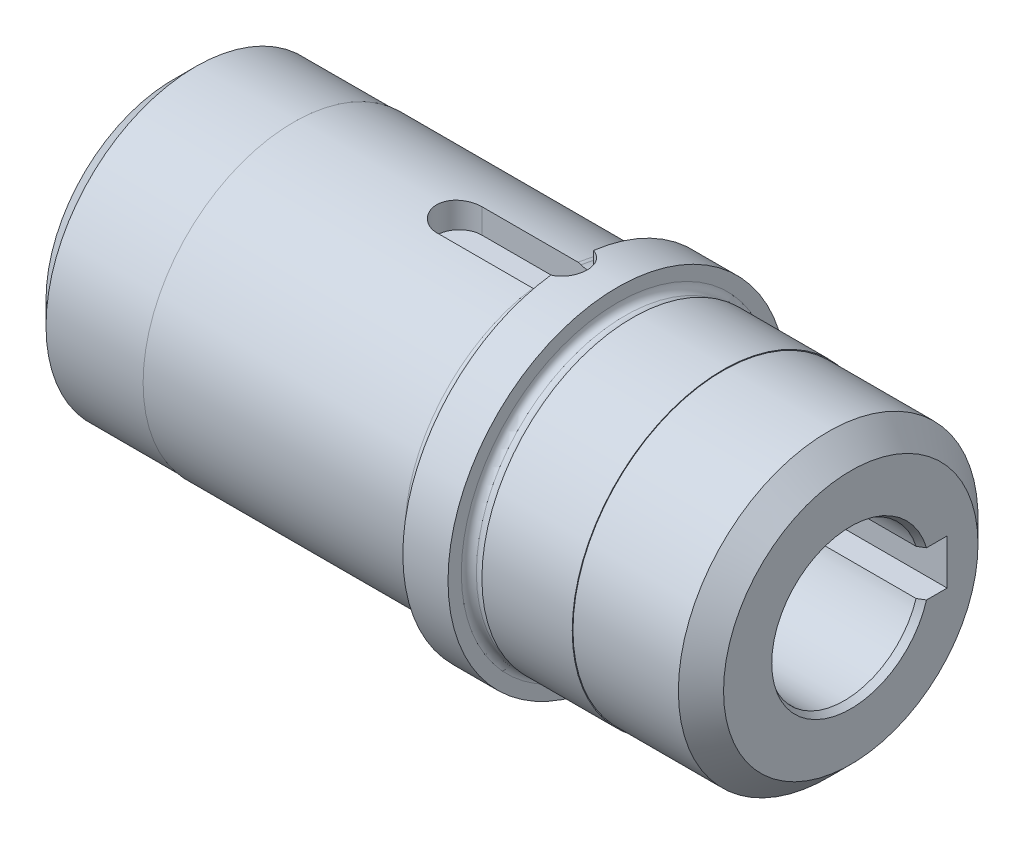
ISO-10303-21;
HEADER;
FILE_DESCRIPTION(('STEP AP214'),'2;1');
FILE_NAME('part.step','',(''),(''),'','','');
FILE_SCHEMA(('AUTOMOTIVE_DESIGN { 1 0 10303 214 1 1 1 1 }'));
ENDSEC;
DATA;
#1=APPLICATION_CONTEXT('core data for automotive mechanical design processes');
#2=APPLICATION_PROTOCOL_DEFINITION('international standard','automotive_design',2000,#1);
#3=PRODUCT_CONTEXT('',#1,'mechanical');
#4=PRODUCT('Part','Part','',(#3));
#5=PRODUCT_RELATED_PRODUCT_CATEGORY('part','',(#4));
#6=PRODUCT_DEFINITION_FORMATION('','',#4);
#7=PRODUCT_DEFINITION_CONTEXT('part definition',#1,'design');
#8=PRODUCT_DEFINITION('design','',#6,#7);
#9=PRODUCT_DEFINITION_SHAPE('','',#8);
#10=(LENGTH_UNIT() NAMED_UNIT(*) SI_UNIT(.MILLI.,.METRE.));
#11=(NAMED_UNIT(*) PLANE_ANGLE_UNIT() SI_UNIT($,.RADIAN.));
#12=(NAMED_UNIT(*) SI_UNIT($,.STERADIAN.) SOLID_ANGLE_UNIT());
#13=UNCERTAINTY_MEASURE_WITH_UNIT(LENGTH_MEASURE(1.E-05),#10,'distance_accuracy_value','');
#14=(GEOMETRIC_REPRESENTATION_CONTEXT(3) GLOBAL_UNCERTAINTY_ASSIGNED_CONTEXT((#13)) GLOBAL_UNIT_ASSIGNED_CONTEXT((#10,
#11,#12)) REPRESENTATION_CONTEXT('',''));
#15=CARTESIAN_POINT('',(0.,0.,0.));
#16=DIRECTION('',(0.,0.,1.));
#17=DIRECTION('',(1.,0.,0.));
#18=AXIS2_PLACEMENT_3D('',#15,#16,#17);
#19=CARTESIAN_POINT('',(0.,0.,0.));
#20=DIRECTION('',(-1.,0.,0.));
#21=DIRECTION('',(0.,0.,1.));
#22=AXIS2_PLACEMENT_3D('',#19,#20,#21);
#23=CYLINDRICAL_SURFACE('',#22,20.);
#24=CARTESIAN_POINT('',(16.,0.,0.));
#25=DIRECTION('',(-1.,0.,0.));
#26=DIRECTION('',(0.,0.,1.));
#27=AXIS2_PLACEMENT_3D('',#24,#25,#26);
#28=CIRCLE('',#27,20.);
#29=CARTESIAN_POINT('',(16.,0.,20.));
#30=VERTEX_POINT('',#29);
#31=EDGE_CURVE('E265',#30,#30,#28,.T.);
#32=ORIENTED_EDGE('',*,*,#31,.F.);
#33=EDGE_LOOP('',(#32));
#34=FACE_BOUND('',#33,.T.);
#35=DIRECTION('',(-1.,0.,0.));
#36=VECTOR('',#35,1.);
#37=CARTESIAN_POINT('',(0.,19.7737199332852,-3.00000000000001));
#38=LINE('',#37,#36);
#39=CARTESIAN_POINT('',(50.7606863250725,19.7737199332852,-3.));
#40=VERTEX_POINT('',#39);
#41=CARTESIAN_POINT('',(38.,19.7737199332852,-3.));
#42=VERTEX_POINT('',#41);
#43=EDGE_CURVE('E409',#40,#42,#38,.T.);
#44=ORIENTED_EDGE('',*,*,#43,.F.);
#45=CARTESIAN_POINT('',(50.7606863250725,0.,0.));
#46=DIRECTION('',(-1.,0.,0.));
#47=DIRECTION('',(0.,0.,1.));
#48=AXIS2_PLACEMENT_3D('',#45,#46,#47);
#49=CIRCLE('',#48,20.);
#50=CARTESIAN_POINT('',(50.7606863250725,19.7737199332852,3.));
#51=VERTEX_POINT('',#50);
#52=EDGE_CURVE('E270',#40,#51,#49,.T.);
#53=ORIENTED_EDGE('',*,*,#52,.T.);
#54=DIRECTION('',(-1.,0.,0.));
#55=VECTOR('',#54,1.);
#56=CARTESIAN_POINT('',(0.,19.7737199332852,2.99999999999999));
#57=LINE('',#56,#55);
#58=CARTESIAN_POINT('',(38.,19.7737199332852,3.));
#59=VERTEX_POINT('',#58);
#60=EDGE_CURVE('E408',#59,#51,#57,.F.);
#61=ORIENTED_EDGE('',*,*,#60,.F.);
#62=CARTESIAN_POINT('',(38.,19.7737199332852,-3.));
#63=CARTESIAN_POINT('',(37.8325088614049,19.7737227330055,-2.99999308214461));
#64=CARTESIAN_POINT('',(37.6649204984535,19.775871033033,-2.98592592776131));
#65=CARTESIAN_POINT('',(37.3344293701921,19.7842262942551,-2.93004393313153));
#66=CARTESIAN_POINT('',(37.1715313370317,19.7904372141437,-2.88820202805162));
#67=CARTESIAN_POINT('',(36.8552524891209,19.8061987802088,-2.77805052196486));
#68=CARTESIAN_POINT('',(36.7018644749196,19.8157468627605,-2.70976123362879));
#69=CARTESIAN_POINT('',(36.4087459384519,19.8371038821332,-2.54870126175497));
#70=CARTESIAN_POINT('',(36.2690135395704,19.8489125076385,-2.45593394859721));
#71=CARTESIAN_POINT('',(36.0060323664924,19.8735657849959,-2.2477580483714));
#72=CARTESIAN_POINT('',(35.8829087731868,19.8864172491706,-2.13219211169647));
#73=CARTESIAN_POINT('',(35.6577250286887,19.9116473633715,-1.88203921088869));
#74=CARTESIAN_POINT('',(35.555666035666,19.9240259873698,-1.74745120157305));
#75=CARTESIAN_POINT('',(35.3750467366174,19.9469869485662,-1.46227271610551));
#76=CARTESIAN_POINT('',(35.2966016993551,19.9575603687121,-1.31160845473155));
#77=CARTESIAN_POINT('',(35.1661768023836,19.9756441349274,-0.999057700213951));
#78=CARTESIAN_POINT('',(35.1141955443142,19.9831546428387,-0.837171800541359));
#79=CARTESIAN_POINT('',(35.0385532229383,19.9942182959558,-0.508062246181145));
#80=CARTESIAN_POINT('',(35.0146825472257,19.9978007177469,-0.340887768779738));
#81=CARTESIAN_POINT('',(34.9952881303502,20.0007048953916,-0.00487040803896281));
#82=CARTESIAN_POINT('',(34.9997628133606,20.0000268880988,0.163972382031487));
#83=CARTESIAN_POINT('',(35.0367666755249,19.9945099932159,0.497103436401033));
#84=CARTESIAN_POINT('',(35.069070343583,19.9897045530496,0.661417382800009));
#85=CARTESIAN_POINT('',(35.1604612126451,19.976510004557,0.982265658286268));
#86=CARTESIAN_POINT('',(35.2195491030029,19.9681208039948,1.13879978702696));
#87=CARTESIAN_POINT('',(35.3630619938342,19.9486438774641,1.44032756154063));
#88=CARTESIAN_POINT('',(35.4475819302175,19.9375460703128,1.58527534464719));
#89=CARTESIAN_POINT('',(35.63949038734,19.9138887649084,1.85901581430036));
#90=CARTESIAN_POINT('',(35.7468804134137,19.9013291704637,1.98780743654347));
#91=CARTESIAN_POINT('',(35.9827368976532,19.8760031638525,2.22690896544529));
#92=CARTESIAN_POINT('',(36.1114002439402,19.8632359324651,2.33702465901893));
#93=CARTESIAN_POINT('',(36.3854821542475,19.8390540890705,2.53413198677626));
#94=CARTESIAN_POINT('',(36.5309008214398,19.827639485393,2.62112347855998));
#95=CARTESIAN_POINT('',(36.8345679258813,19.8074555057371,2.76953929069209));
#96=CARTESIAN_POINT('',(36.9928262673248,19.7986881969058,2.83094364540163));
#97=CARTESIAN_POINT('',(37.3175705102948,19.7848280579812,2.92624672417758));
#98=CARTESIAN_POINT('',(37.4840558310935,19.779734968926,2.96014738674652));
#99=CARTESIAN_POINT('',(37.818800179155,19.7738490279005,2.99921440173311));
#100=CARTESIAN_POINT('',(37.9870263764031,19.7730149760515,3.00465606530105));
#101=CARTESIAN_POINT('',(38.3219883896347,19.7756321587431,2.98738114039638));
#102=CARTESIAN_POINT('',(38.4887242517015,19.7790832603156,2.96466542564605));
#103=CARTESIAN_POINT('',(38.8151196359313,19.7898440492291,2.89195405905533));
#104=CARTESIAN_POINT('',(38.9748104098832,19.7971343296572,2.84209557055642));
#105=CARTESIAN_POINT('',(39.2835681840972,19.8147360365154,2.71665663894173));
#106=CARTESIAN_POINT('',(39.4326346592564,19.8250476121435,2.64107492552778));
#107=CARTESIAN_POINT('',(39.7171465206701,19.8476271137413,2.46567355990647));
#108=CARTESIAN_POINT('',(39.8524808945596,19.8599091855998,2.36567569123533));
#109=CARTESIAN_POINT('',(40.1045457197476,19.8850031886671,2.14452833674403));
#110=CARTESIAN_POINT('',(40.2212751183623,19.8978151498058,2.02337765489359));
#111=CARTESIAN_POINT('',(40.4338052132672,19.9226541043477,1.76215123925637));
#112=CARTESIAN_POINT('',(40.5294234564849,19.9346736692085,1.62192625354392));
#113=CARTESIAN_POINT('',(40.6957458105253,19.9564581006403,1.32724416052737));
#114=CARTESIAN_POINT('',(40.76645060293,19.9662230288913,1.17278744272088));
#115=CARTESIAN_POINT('',(40.8806474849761,19.9823653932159,0.854595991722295));
#116=CARTESIAN_POINT('',(40.9242393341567,19.9887552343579,0.690897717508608));
#117=CARTESIAN_POINT('',(40.9832957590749,19.997479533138,0.358401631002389));
#118=CARTESIAN_POINT('',(40.9987621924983,19.9998142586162,0.189604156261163));
#119=CARTESIAN_POINT('',(41.0010834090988,20.0001625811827,-0.146529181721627));
#120=CARTESIAN_POINT('',(40.988217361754,19.9982183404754,-0.313863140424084));
#121=CARTESIAN_POINT('',(40.9348372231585,19.9903122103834,-0.643959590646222));
#122=CARTESIAN_POINT('',(40.8943232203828,19.9843503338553,-0.806722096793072));
#123=CARTESIAN_POINT('',(40.7868962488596,19.9690757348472,-1.12297874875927));
#124=CARTESIAN_POINT('',(40.7200026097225,19.9597654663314,-1.27647958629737));
#125=CARTESIAN_POINT('',(40.5617450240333,19.9388166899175,-1.5701222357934));
#126=CARTESIAN_POINT('',(40.4703802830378,19.9271781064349,-1.71026361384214));
#127=CARTESIAN_POINT('',(40.2647646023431,19.9027302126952,-1.97462517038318));
#128=CARTESIAN_POINT('',(40.1503075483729,19.8899109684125,-2.09868413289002));
#129=CARTESIAN_POINT('',(39.9021898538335,19.8646200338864,-2.32593616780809));
#130=CARTESIAN_POINT('',(39.7685247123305,19.8521484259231,-2.4291243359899));
#131=CARTESIAN_POINT('',(39.4849020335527,19.8288896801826,-2.61222621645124));
#132=CARTESIAN_POINT('',(39.334857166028,19.8181124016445,-2.69200588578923));
#133=CARTESIAN_POINT('',(39.0234064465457,19.7995781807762,-2.82511227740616));
#134=CARTESIAN_POINT('',(38.8620125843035,19.7918181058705,-2.87846645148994));
#135=CARTESIAN_POINT('',(38.5832451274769,19.7819897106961,-2.94509903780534));
#136=CARTESIAN_POINT('',(38.4675932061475,19.7789049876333,-2.96565539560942));
#137=CARTESIAN_POINT('',(38.2346434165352,19.7747691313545,-2.99310821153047));
#138=CARTESIAN_POINT('',(38.1173455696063,19.7737179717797,-3.00000484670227));
#139=CARTESIAN_POINT('',(38.,19.7737199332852,-3.));
#140=B_SPLINE_CURVE_WITH_KNOTS('',3,(#62,#63,#64,#65,#66,#67,#68,#69,#70,#71,#72,#73,#74,#75,
#76,#77,#78,#79,#80,#81,#82,#83,#84,#85,#86,#87,#88,#89,#90,#91,#92,#93,#94,#95,#96,#97,#98,#99,
#100,#101,#102,#103,#104,#105,#106,#107,#108,#109,#110,#111,#112,#113,#114,#115,#116,#117,#118,
#119,#120,#121,#122,#123,#124,#125,#126,#127,#128,#129,#130,#131,#132,#133,#134,#135,#136,#137,
#138,#139),.UNSPECIFIED.,.T.,.F.,(4,2,2,2,2,2,2,2,2,2,2,2,2,2,2,2,2,2,2,2,2,2,2,2,2,2,2,2,2,2,2,
2,2,2,2,2,2,2,4),(0.,0.502044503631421,1.00457893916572,1.50672817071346,2.00880829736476,
2.51448317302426,3.02018584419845,3.52831844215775,4.03642418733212,4.54071665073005,
5.04498107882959,5.54519725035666,6.04542629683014,6.54754632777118,7.04969941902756,
7.5567908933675,8.06388549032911,8.57137503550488,9.07882880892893,9.58136429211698,
10.0838841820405,10.5838878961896,11.0839163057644,11.5877097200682,12.0915316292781,
12.5995507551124,13.1075559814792,13.6136808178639,14.1197722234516,14.6208992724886,
15.1220247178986,15.6227836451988,16.1235588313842,16.6290190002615,17.1345978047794,
17.6430175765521,18.1509080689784,18.5026488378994,18.854385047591),.UNSPECIFIED.);
#141=EDGE_CURVE('E11',#42,#59,#140,.T.);
#142=ORIENTED_EDGE('',*,*,#141,.F.);
#143=EDGE_LOOP('',(#44,#53,#61,#142));
#144=FACE_BOUND('',#143,.T.);
#145=ADVANCED_FACE('F32',(#34,#144),#23,.T.);
#146=CARTESIAN_POINT('',(50.7606863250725,0.,0.));
#147=DIRECTION('',(-1.,0.,0.));
#148=DIRECTION('',(0.,0.,1.));
#149=AXIS2_PLACEMENT_3D('',#146,#147,#148);
#150=TOROIDAL_SURFACE('',#149,19.,1.);
#151=CARTESIAN_POINT('',(50.9762757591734,17.7720883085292,-2.99999991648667));
#152=CARTESIAN_POINT('',(51.0308542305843,17.784311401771,-2.99999989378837));
#153=CARTESIAN_POINT('',(51.0844339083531,17.8011896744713,-2.99999997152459));
#154=CARTESIAN_POINT('',(51.1880276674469,17.84374824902,-3.00000002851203));
#155=CARTESIAN_POINT('',(51.2380370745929,17.8694398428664,-3.00000000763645));
#156=CARTESIAN_POINT('',(51.3329990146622,17.9288128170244,-2.99999999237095));
#157=CARTESIAN_POINT('',(51.3779563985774,17.9624864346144,-2.9999999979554));
#158=CARTESIAN_POINT('',(51.4616298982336,18.036830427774,-3.00000000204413));
#159=CARTESIAN_POINT('',(51.5003474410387,18.0774991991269,-3.00000000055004));
#160=CARTESIAN_POINT('',(51.5708513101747,18.1650685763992,-2.99999999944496));
#161=CARTESIAN_POINT('',(51.602571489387,18.2120224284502,-2.99999999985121));
#162=CARTESIAN_POINT('',(51.6577960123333,18.3105377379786,-3.00000000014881));
#163=CARTESIAN_POINT('',(51.6812994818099,18.3620996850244,-3.00000000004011));
#164=CARTESIAN_POINT('',(51.7197222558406,18.4690685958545,-2.99999999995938));
#165=CARTESIAN_POINT('',(51.7345290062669,18.5245160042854,-2.99999999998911));
#166=CARTESIAN_POINT('',(51.7547005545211,18.6371032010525,-3.00000000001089));
#167=CARTESIAN_POINT('',(51.7600648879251,18.6942430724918,-3.00000000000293));
#168=CARTESIAN_POINT('',(51.7612099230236,18.8090446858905,-2.99999999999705));
#169=CARTESIAN_POINT('',(51.7569192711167,18.8667071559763,-2.99999999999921));
#170=CARTESIAN_POINT('',(51.7387123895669,18.9804933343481,-3.00000000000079));
#171=CARTESIAN_POINT('',(51.724796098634,19.0366170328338,-3.00000000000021));
#172=CARTESIAN_POINT('',(51.6877149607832,19.1456772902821,-2.99999999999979));
#173=CARTESIAN_POINT('',(51.6645569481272,19.1986161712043,-2.99999999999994));
#174=CARTESIAN_POINT('',(51.60961251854,19.2998109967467,-3.00000000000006));
#175=CARTESIAN_POINT('',(51.5778263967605,19.3480671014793,-3.00000000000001));
#176=CARTESIAN_POINT('',(51.506787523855,19.4381019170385,-2.99999999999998));
#177=CARTESIAN_POINT('',(51.4675966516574,19.4799294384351,-3.));
#178=CARTESIAN_POINT('',(51.3826765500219,19.5563173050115,-3.));
#179=CARTESIAN_POINT('',(51.3369477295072,19.5908781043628,-3.));
#180=CARTESIAN_POINT('',(51.2408122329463,19.651329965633,-3.));
#181=CARTESIAN_POINT('',(51.1904652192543,19.6773159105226,-3.));
#182=CARTESIAN_POINT('',(51.0860916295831,19.7203673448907,-3.));
#183=CARTESIAN_POINT('',(51.032065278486,19.7374333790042,-3.));
#184=CARTESIAN_POINT('',(50.9224527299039,19.7619957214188,-3.));
#185=CARTESIAN_POINT('',(50.8668877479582,19.7695867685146,-3.));
#186=CARTESIAN_POINT('',(50.7552744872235,19.7752827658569,-3.));
#187=CARTESIAN_POINT('',(50.6992262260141,19.773388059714,-3.));
#188=CARTESIAN_POINT('',(50.5885201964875,19.7602029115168,-3.));
#189=CARTESIAN_POINT('',(50.5338570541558,19.7489575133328,-3.));
#190=CARTESIAN_POINT('',(50.4271885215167,19.717468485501,-3.));
#191=CARTESIAN_POINT('',(50.3751831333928,19.6972248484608,-3.));
#192=CARTESIAN_POINT('',(50.2751721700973,19.6482879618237,-3.));
#193=CARTESIAN_POINT('',(50.2271756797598,19.6195761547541,-3.));
#194=CARTESIAN_POINT('',(50.1366325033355,19.5545649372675,-3.));
#195=CARTESIAN_POINT('',(50.0940860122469,19.5182652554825,-3.));
#196=CARTESIAN_POINT('',(50.0152619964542,19.4387947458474,-3.));
#197=CARTESIAN_POINT('',(49.9790397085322,19.3955691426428,-3.));
#198=CARTESIAN_POINT('',(49.9142690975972,19.3037082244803,-3.));
#199=CARTESIAN_POINT('',(49.8857212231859,19.2550725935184,-3.));
#200=CARTESIAN_POINT('',(49.8367659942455,19.1531805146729,-3.));
#201=CARTESIAN_POINT('',(49.8164549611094,19.0998777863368,-3.00000000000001));
#202=CARTESIAN_POINT('',(49.7849701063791,18.9906388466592,-2.99999999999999));
#203=CARTESIAN_POINT('',(49.773796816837,18.9347024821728,-2.99999999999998));
#204=CARTESIAN_POINT('',(49.7608058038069,18.821186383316,-3.00000000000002));
#205=CARTESIAN_POINT('',(49.7590826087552,18.7635958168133,-3.00000000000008));
#206=CARTESIAN_POINT('',(49.765284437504,18.648935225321,-2.99999999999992));
#207=CARTESIAN_POINT('',(49.7732098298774,18.5918652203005,-2.99999999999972));
#208=CARTESIAN_POINT('',(49.7985507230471,18.4796167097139,-3.00000000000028));
#209=CARTESIAN_POINT('',(49.8160061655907,18.4244472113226,-3.00000000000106));
#210=CARTESIAN_POINT('',(49.8599672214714,18.3178379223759,-2.99999999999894));
#211=CARTESIAN_POINT('',(49.8864727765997,18.2663981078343,-2.99999999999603));
#212=CARTESIAN_POINT('',(49.947694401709,18.1689450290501,-3.00000000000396));
#213=CARTESIAN_POINT('',(49.982377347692,18.1229109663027,-3.00000000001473));
#214=CARTESIAN_POINT('',(50.0590578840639,18.0374030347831,-2.99999999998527));
#215=CARTESIAN_POINT('',(50.1010547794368,17.9979285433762,-2.99999999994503));
#216=CARTESIAN_POINT('',(50.190675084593,17.9271418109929,-3.00000000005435));
#217=CARTESIAN_POINT('',(50.2382300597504,17.8957429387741,-3.00000000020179));
#218=CARTESIAN_POINT('',(50.338006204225,17.8414927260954,-2.99999999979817));
#219=CARTESIAN_POINT('',(50.3902281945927,17.8186428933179,-2.99999999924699));
#220=CARTESIAN_POINT('',(50.4971172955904,17.7824527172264,-3.00000000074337));
#221=CARTESIAN_POINT('',(50.5517445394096,17.7689943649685,-3.00000000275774));
#222=CARTESIAN_POINT('',(50.6624430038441,17.751552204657,-2.99999999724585));
#223=CARTESIAN_POINT('',(50.7185122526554,17.7475560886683,-2.99999998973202));
#224=CARTESIAN_POINT('',(50.8084049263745,17.7488084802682,-3.00000000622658));
#225=CARTESIAN_POINT('',(50.842298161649,17.7510374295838,-3.00000001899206));
#226=CARTESIAN_POINT('',(50.9096754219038,17.7589690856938,-2.9999999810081));
#227=CARTESIAN_POINT('',(50.9431594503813,17.764671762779,-2.99999993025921));
#228=CARTESIAN_POINT('',(50.9762757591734,17.7720883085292,-2.99999991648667));
#229=B_SPLINE_CURVE_WITH_KNOTS('',3,(#151,#152,#153,#154,#155,#156,#157,#158,#159,#160,#161,
#162,#163,#164,#165,#166,#167,#168,#169,#170,#171,#172,#173,#174,#175,#176,#177,#178,#179,#180,
#181,#182,#183,#184,#185,#186,#187,#188,#189,#190,#191,#192,#193,#194,#195,#196,#197,#198,#199,
#200,#201,#202,#203,#204,#205,#206,#207,#208,#209,#210,#211,#212,#213,#214,#215,#216,#217,#218,
#219,#220,#221,#222,#223,#224,#225,#226,#227,#228),.UNSPECIFIED.,.T.,.F.,(4,2,2,2,2,2,2,2,2,2,2,
2,2,2,2,2,2,2,2,2,2,2,2,2,2,2,2,2,2,2,2,2,2,2,2,2,2,2,4),(0.,0.167665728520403,
0.335547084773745,0.503265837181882,0.670946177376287,0.840149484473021,1.00937078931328,
1.18073649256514,1.35211062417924,1.52475542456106,1.69740132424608,1.86991978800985,
2.04243235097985,2.21356239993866,2.3846817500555,2.5538386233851,2.72298516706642,
2.89042653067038,3.05786182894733,3.22449520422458,3.3911287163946,3.5581301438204,
3.72513754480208,3.8935376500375,4.06194759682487,4.23227376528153,4.40260985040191,
4.57464672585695,4.74669017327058,4.91946027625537,5.09222926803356,5.26431009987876,
5.43637458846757,5.60650803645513,5.77667147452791,5.94465622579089,6.11242235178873,
6.21415692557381,6.31589062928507),.UNSPECIFIED.);
#230=CARTESIAN_POINT('',(51.1737908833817,19.683376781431,-3.));
#231=VERTEX_POINT('',#230);
#232=EDGE_CURVE('E412',#231,#40,#229,.T.);
#233=ORIENTED_EDGE('',*,*,#232,.F.);
#234=CARTESIAN_POINT('',(51.1737908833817,0.,0.));
#235=DIRECTION('',(-1.,0.,0.));
#236=DIRECTION('',(0.,0.,1.));
#237=AXIS2_PLACEMENT_3D('',#234,#235,#236);
#238=CIRCLE('',#237,19.910683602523);
#239=CARTESIAN_POINT('',(51.1737908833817,19.683376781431,3.));
#240=VERTEX_POINT('',#239);
#241=EDGE_CURVE('E401',#231,#240,#238,.T.);
#242=ORIENTED_EDGE('',*,*,#241,.T.);
#243=CARTESIAN_POINT('',(50.9762757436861,17.7720883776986,3.));
#244=CARTESIAN_POINT('',(50.9221671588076,17.7599757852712,3.));
#245=CARTESIAN_POINT('',(50.8669982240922,17.7524203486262,3.));
#246=CARTESIAN_POINT('',(50.7561317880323,17.7466854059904,3.));
#247=CARTESIAN_POINT('',(50.7004337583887,17.7485165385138,3.));
#248=CARTESIAN_POINT('',(50.590163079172,17.761510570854,3.));
#249=CARTESIAN_POINT('',(50.5355898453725,17.7726684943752,3.));
#250=CARTESIAN_POINT('',(50.4290989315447,17.803964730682,3.));
#251=CARTESIAN_POINT('',(50.3771806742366,17.8241010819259,3.));
#252=CARTESIAN_POINT('',(50.2773032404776,17.872804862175,3.));
#253=CARTESIAN_POINT('',(50.2293542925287,17.9013932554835,3.));
#254=CARTESIAN_POINT('',(50.1388682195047,17.966134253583,3.));
#255=CARTESIAN_POINT('',(50.0963315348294,18.0022874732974,3.));
#256=CARTESIAN_POINT('',(50.0173825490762,18.0815368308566,3.));
#257=CARTESIAN_POINT('',(49.9810409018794,18.1247033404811,3.));
#258=CARTESIAN_POINT('',(49.9160072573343,18.2164573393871,3.));
#259=CARTESIAN_POINT('',(49.887315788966,18.2650452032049,3.));
#260=CARTESIAN_POINT('',(49.8380027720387,18.3669524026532,3.));
#261=CARTESIAN_POINT('',(49.8174928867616,18.4203257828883,3.));
#262=CARTESIAN_POINT('',(49.7856283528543,18.5297391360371,3.));
#263=CARTESIAN_POINT('',(49.7742742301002,18.5857792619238,3.));
#264=CARTESIAN_POINT('',(49.7609563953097,18.6995099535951,3.));
#265=CARTESIAN_POINT('',(49.7590835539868,18.7572111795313,3.));
#266=CARTESIAN_POINT('',(49.7650300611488,18.872113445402,3.));
#267=CARTESIAN_POINT('',(49.7728496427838,18.9293144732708,3.));
#268=CARTESIAN_POINT('',(49.7980070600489,19.0417022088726,3.));
#269=CARTESIAN_POINT('',(49.8153632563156,19.0968848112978,3.));
#270=CARTESIAN_POINT('',(49.8591485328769,19.2035266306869,3.));
#271=CARTESIAN_POINT('',(49.8855774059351,19.2549859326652,3.));
#272=CARTESIAN_POINT('',(49.9466066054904,19.3523770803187,3.));
#273=CARTESIAN_POINT('',(49.9811568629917,19.3983402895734,3.));
#274=CARTESIAN_POINT('',(50.0575616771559,19.4837329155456,3.));
#275=CARTESIAN_POINT('',(50.0994158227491,19.5231626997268,3.));
#276=CARTESIAN_POINT('',(50.1887548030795,19.5939070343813,3.));
#277=CARTESIAN_POINT('',(50.2361733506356,19.625305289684,3.));
#278=CARTESIAN_POINT('',(50.3356549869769,19.6795912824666,3.));
#279=CARTESIAN_POINT('',(50.3877177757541,19.7024795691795,3.));
#280=CARTESIAN_POINT('',(50.4943918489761,19.738840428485,3.));
#281=CARTESIAN_POINT('',(50.5489687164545,19.7524140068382,3.));
#282=CARTESIAN_POINT('',(50.6596312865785,19.7701360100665,3.));
#283=CARTESIAN_POINT('',(50.7157169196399,19.7742848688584,3.));
#284=CARTESIAN_POINT('',(50.8273999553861,19.7730354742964,3.));
#285=CARTESIAN_POINT('',(50.8829980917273,19.767701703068,3.));
#286=CARTESIAN_POINT('',(50.9925079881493,19.7477739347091,3.));
#287=CARTESIAN_POINT('',(51.0464197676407,19.7331800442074,3.));
#288=CARTESIAN_POINT('',(51.1510341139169,19.6951715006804,3.));
#289=CARTESIAN_POINT('',(51.2017368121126,19.6717572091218,3.));
#290=CARTESIAN_POINT('',(51.2985267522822,19.6168025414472,3.));
#291=CARTESIAN_POINT('',(51.3446138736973,19.5852619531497,3.));
#292=CARTESIAN_POINT('',(51.431202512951,19.5147399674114,3.));
#293=CARTESIAN_POINT('',(51.4716649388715,19.4757105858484,3.));
#294=CARTESIAN_POINT('',(51.54554852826,19.3914773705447,3.));
#295=CARTESIAN_POINT('',(51.5789693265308,19.3462732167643,3.));
#296=CARTESIAN_POINT('',(51.6382102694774,19.2504513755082,3.));
#297=CARTESIAN_POINT('',(51.6639439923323,19.1997802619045,3.));
#298=CARTESIAN_POINT('',(51.706644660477,19.0948700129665,3.));
#299=CARTESIAN_POINT('',(51.7236110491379,19.0406306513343,3.));
#300=CARTESIAN_POINT('',(51.7484785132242,18.9294879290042,3.));
#301=CARTESIAN_POINT('',(51.7562784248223,18.8725619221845,3.));
#302=CARTESIAN_POINT('',(51.7622780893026,18.7582053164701,3.));
#303=CARTESIAN_POINT('',(51.7604773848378,18.700774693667,3.));
#304=CARTESIAN_POINT('',(51.7472852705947,18.5866470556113,3.));
#305=CARTESIAN_POINT('',(51.7358318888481,18.5299571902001,3.));
#306=CARTESIAN_POINT('',(51.7035595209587,18.4193094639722,3.));
#307=CARTESIAN_POINT('',(51.6827408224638,18.3653515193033,3.));
#308=CARTESIAN_POINT('',(51.632332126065,18.2617940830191,3.));
#309=CARTESIAN_POINT('',(51.6027546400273,18.2121885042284,3.));
#310=CARTESIAN_POINT('',(51.5356093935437,18.118693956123,3.));
#311=CARTESIAN_POINT('',(51.4980399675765,18.0748061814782,3.));
#312=CARTESIAN_POINT('',(51.4163263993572,17.994439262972,3.));
#313=CARTESIAN_POINT('',(51.3722426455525,17.9578986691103,3.));
#314=CARTESIAN_POINT('',(51.2785295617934,17.8928949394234,3.));
#315=CARTESIAN_POINT('',(51.2289075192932,17.8644213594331,3.));
#316=CARTESIAN_POINT('',(51.1450990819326,17.8254746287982,3.));
#317=CARTESIAN_POINT('',(51.1121562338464,17.8122638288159,3.));
#318=CARTESIAN_POINT('',(51.0450453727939,17.7894436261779,3.));
#319=CARTESIAN_POINT('',(51.0108773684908,17.7798341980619,3.));
#320=CARTESIAN_POINT('',(50.9762757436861,17.7720883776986,3.));
#321=B_SPLINE_CURVE_WITH_KNOTS('',3,(#243,#244,#245,#246,#247,#248,#249,#250,#251,#252,#253,
#254,#255,#256,#257,#258,#259,#260,#261,#262,#263,#264,#265,#266,#267,#268,#269,#270,#271,#272,
#273,#274,#275,#276,#277,#278,#279,#280,#281,#282,#283,#284,#285,#286,#287,#288,#289,#290,#291,
#292,#293,#294,#295,#296,#297,#298,#299,#300,#301,#302,#303,#304,#305,#306,#307,#308,#309,#310,
#311,#312,#313,#314,#315,#316,#317,#318,#319,#320),.UNSPECIFIED.,.T.,.F.,(4,2,2,2,2,2,2,2,2,2,2,
2,2,2,2,2,2,2,2,2,2,2,2,2,2,2,2,2,2,2,2,2,2,2,2,2,2,2,4),(0.,0.166213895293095,
0.332616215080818,0.498929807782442,0.665207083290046,0.831900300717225,0.998607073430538,
1.16710360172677,1.33561177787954,1.50634695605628,1.67709193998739,1.84947032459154,
2.02185285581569,2.19456844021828,2.36728007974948,2.53895364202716,2.71061754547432,
2.88041188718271,3.05019526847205,3.21810717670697,3.38601135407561,3.55277814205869,
3.71954300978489,3.88630104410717,4.05306343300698,4.22093235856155,4.38880998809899,
4.55850950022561,4.72821978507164,4.89978595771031,5.07136030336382,5.24404465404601,
5.41672370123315,5.58915725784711,5.76162678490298,5.9325876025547,6.10332605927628,
6.20961809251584,6.31590937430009),.UNSPECIFIED.);
#322=EDGE_CURVE('E414',#51,#240,#321,.T.);
#323=ORIENTED_EDGE('',*,*,#322,.F.);
#324=ORIENTED_EDGE('',*,*,#52,.F.);
#325=EDGE_LOOP('',(#233,#242,#323,#324));
#326=FACE_BOUND('',#325,.T.);
#327=ADVANCED_FACE('F235',(#326),#150,.T.);
#328=CARTESIAN_POINT('',(52.,0.,0.));
#329=DIRECTION('',(-1.,0.,0.));
#330=DIRECTION('',(0.,0.,1.));
#331=AXIS2_PLACEMENT_3D('',#328,#329,#330);
#332=TOROIDAL_SURFACE('',#331,21.7320508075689,2.);
#333=CARTESIAN_POINT('',(51.5991902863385,19.5437119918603,-3.));
#334=CARTESIAN_POINT('',(51.4895976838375,19.5663976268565,-3.));
#335=CARTESIAN_POINT('',(51.3818505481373,19.5984160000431,-3.));
#336=CARTESIAN_POINT('',(51.1731974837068,19.6801685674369,-3.));
#337=CARTESIAN_POINT('',(51.0723004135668,19.7299252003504,-3.));
#338=CARTESIAN_POINT('',(50.8803558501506,19.8456009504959,-3.));
#339=CARTESIAN_POINT('',(50.7892997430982,19.9115057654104,-3.));
#340=CARTESIAN_POINT('',(50.6194677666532,20.0575421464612,-3.));
#341=CARTESIAN_POINT('',(50.5406890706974,20.1376704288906,-3.));
#342=CARTESIAN_POINT('',(50.3969581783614,20.3105148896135,-3.));
#343=CARTESIAN_POINT('',(50.332114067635,20.4033209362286,-3.));
#344=CARTESIAN_POINT('',(50.2187396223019,20.5984177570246,-3.));
#345=CARTESIAN_POINT('',(50.1702108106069,20.7007094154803,-3.));
#346=CARTESIAN_POINT('',(50.0903541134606,20.912987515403,-3.));
#347=CARTESIAN_POINT('',(50.0592055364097,21.023041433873,-3.));
#348=CARTESIAN_POINT('',(50.0157131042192,21.2468054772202,-3.));
#349=CARTESIAN_POINT('',(50.0033699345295,21.3605157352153,-3.));
#350=CARTESIAN_POINT('',(49.997818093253,21.5890302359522,-3.));
#351=CARTESIAN_POINT('',(50.004714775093,21.7038370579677,-3.));
#352=CARTESIAN_POINT('',(50.0377027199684,21.9306612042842,-3.));
#353=CARTESIAN_POINT('',(50.0637940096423,22.0426785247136,-3.));
#354=CARTESIAN_POINT('',(50.1344446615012,22.260606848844,-3.));
#355=CARTESIAN_POINT('',(50.1789852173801,22.3665239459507,-3.));
#356=CARTESIAN_POINT('',(50.2853251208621,22.5693104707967,-3.));
#357=CARTESIAN_POINT('',(50.3471240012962,22.6661801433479,-3.));
#358=CARTESIAN_POINT('',(50.4858283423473,22.8474585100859,-3.));
#359=CARTESIAN_POINT('',(50.5626366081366,22.9319415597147,-3.));
#360=CARTESIAN_POINT('',(50.7294542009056,23.0866779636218,-3.));
#361=CARTESIAN_POINT('',(50.8194629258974,23.1569319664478,-3.));
#362=CARTESIAN_POINT('',(51.0093115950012,23.2805880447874,-3.));
#363=CARTESIAN_POINT('',(51.1090622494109,23.3341272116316,-3.));
#364=CARTESIAN_POINT('',(51.3161835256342,23.4235583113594,-3.));
#365=CARTESIAN_POINT('',(51.423553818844,23.4594510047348,-3.));
#366=CARTESIAN_POINT('',(51.6420313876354,23.5123199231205,-3.));
#367=CARTESIAN_POINT('',(51.7531060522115,23.5294309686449,-3.));
#368=CARTESIAN_POINT('',(51.9765493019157,23.5446892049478,-3.));
#369=CARTESIAN_POINT('',(52.0889178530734,23.5428368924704,-3.));
#370=CARTESIAN_POINT('',(52.3113409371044,23.5202648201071,-3.));
#371=CARTESIAN_POINT('',(52.4214022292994,23.4996115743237,-3.));
#372=CARTESIAN_POINT('',(52.6365014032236,23.4401426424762,-3.));
#373=CARTESIAN_POINT('',(52.7415392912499,23.4013269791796,-3.));
#374=CARTESIAN_POINT('',(52.9437684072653,23.3066133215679,-3.));
#375=CARTESIAN_POINT('',(53.0409494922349,23.2506936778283,-3.));
#376=CARTESIAN_POINT('',(53.2246127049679,23.1234191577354,-3.));
#377=CARTESIAN_POINT('',(53.3110945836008,23.0520639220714,-3.));
#378=CARTESIAN_POINT('',(53.4714406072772,22.8955292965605,-3.));
#379=CARTESIAN_POINT('',(53.5452308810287,22.8102742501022,-3.));
#380=CARTESIAN_POINT('',(53.6775890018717,22.6286715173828,-3.));
#381=CARTESIAN_POINT('',(53.7361562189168,22.5323233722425,-3.));
#382=CARTESIAN_POINT('',(53.8369164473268,22.330429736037,-3.));
#383=CARTESIAN_POINT('',(53.878971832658,22.224815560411,-3.));
#384=CARTESIAN_POINT('',(53.9449088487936,22.0080591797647,-3.));
#385=CARTESIAN_POINT('',(53.9687896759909,21.8969167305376,-3.));
#386=CARTESIAN_POINT('',(53.9978728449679,21.6713339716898,-3.));
#387=CARTESIAN_POINT('',(54.0029285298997,21.5568747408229,-3.));
#388=CARTESIAN_POINT('',(53.9938372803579,21.3287196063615,-3.));
#389=CARTESIAN_POINT('',(53.9796896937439,21.2150237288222,-3.));
#390=CARTESIAN_POINT('',(53.9324866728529,20.9911407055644,-3.));
#391=CARTESIAN_POINT('',(53.899354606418,20.8809697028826,-3.));
#392=CARTESIAN_POINT('',(53.8150279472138,20.6677684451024,-3.));
#393=CARTESIAN_POINT('',(53.7638333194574,20.5647382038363,-3.));
#394=CARTESIAN_POINT('',(53.6449057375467,20.3690013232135,-3.));
#395=CARTESIAN_POINT('',(53.5772074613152,20.2762736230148,-3.));
#396=CARTESIAN_POINT('',(53.4270875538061,20.1036220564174,-3.));
#397=CARTESIAN_POINT('',(53.3446670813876,20.0236971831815,-3.));
#398=CARTESIAN_POINT('',(53.1681601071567,19.8796499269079,-3.));
#399=CARTESIAN_POINT('',(53.0741766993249,19.8154012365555,-3.));
#400=CARTESIAN_POINT('',(52.876635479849,19.7037819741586,-3.));
#401=CARTESIAN_POINT('',(52.7730758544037,19.6564146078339,-3.));
#402=CARTESIAN_POINT('',(52.5605173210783,19.5804411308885,-3.));
#403=CARTESIAN_POINT('',(52.4515862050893,19.5516449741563,-3.));
#404=CARTESIAN_POINT('',(52.2305134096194,19.5129538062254,-3.));
#405=CARTESIAN_POINT('',(52.1183760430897,19.5030345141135,-3.));
#406=CARTESIAN_POINT('',(51.9379567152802,19.5024511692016,-3.));
#407=CARTESIAN_POINT('',(51.8696396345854,19.5057830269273,-3.));
#408=CARTESIAN_POINT('',(51.7337157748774,19.5194873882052,-3.));
#409=CARTESIAN_POINT('',(51.6661089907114,19.5298598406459,-3.));
#410=CARTESIAN_POINT('',(51.5991902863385,19.5437119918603,-3.));
#411=B_SPLINE_CURVE_WITH_KNOTS('',3,(#333,#334,#335,#336,#337,#338,#339,#340,#341,#342,#343,
#344,#345,#346,#347,#348,#349,#350,#351,#352,#353,#354,#355,#356,#357,#358,#359,#360,#361,#362,
#363,#364,#365,#366,#367,#368,#369,#370,#371,#372,#373,#374,#375,#376,#377,#378,#379,#380,#381,
#382,#383,#384,#385,#386,#387,#388,#389,#390,#391,#392,#393,#394,#395,#396,#397,#398,#399,#400,
#401,#402,#403,#404,#405,#406,#407,#408,#409,#410),.UNSPECIFIED.,.T.,.F.,(4,2,2,2,2,2,2,2,2,2,2,
2,2,2,2,2,2,2,2,2,2,2,2,2,2,2,2,2,2,2,2,2,2,2,2,2,2,2,4),(0.,0.335495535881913,
0.671416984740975,1.00704197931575,1.34258959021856,1.68065281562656,2.0187475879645,
2.3602688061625,2.70180247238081,3.04520997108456,3.38861794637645,3.73167672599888,
4.07472622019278,4.41562377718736,4.75650579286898,5.09451369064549,5.43250702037,
5.7680579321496,6.10360005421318,6.43795968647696,6.77231889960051,7.10710309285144,
7.44189508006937,7.77857421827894,8.11526728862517,8.45470996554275,8.79416765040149,
9.13626440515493,9.47837277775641,9.82187192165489,10.1653717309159,10.5081558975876,
10.8509130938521,11.1908099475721,11.5307713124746,11.8671960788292,12.2031878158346,
12.4080473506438,12.6129053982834),.UNSPECIFIED.);
#412=CARTESIAN_POINT('',(52.,19.502662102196,-3.));
#413=VERTEX_POINT('',#412);
#414=EDGE_CURVE('E419',#413,#231,#411,.T.);
#415=ORIENTED_EDGE('',*,*,#414,.F.);
#416=CARTESIAN_POINT('',(52.,0.,0.));
#417=DIRECTION('',(-1.,0.,0.));
#418=DIRECTION('',(0.,0.,1.));
#419=AXIS2_PLACEMENT_3D('',#416,#417,#418);
#420=CIRCLE('',#419,19.7320508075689);
#421=CARTESIAN_POINT('',(52.,19.502662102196,3.));
#422=VERTEX_POINT('',#421);
#423=EDGE_CURVE('E398',#413,#422,#420,.T.);
#424=ORIENTED_EDGE('',*,*,#423,.T.);
#425=CARTESIAN_POINT('',(51.5991902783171,19.5437119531,2.99999995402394));
#426=CARTESIAN_POINT('',(51.708034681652,19.521191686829,2.99999994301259));
#427=CARTESIAN_POINT('',(51.8188576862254,19.5078436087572,2.99999998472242));
#428=CARTESIAN_POINT('',(52.0412587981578,19.4999560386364,3.00000001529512));
#429=CARTESIAN_POINT('',(52.1528376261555,19.5054381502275,3.00000000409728));
#430=CARTESIAN_POINT('',(52.3734359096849,19.5350662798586,2.99999999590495));
#431=CARTESIAN_POINT('',(52.4824567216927,19.559202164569,2.99999999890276));
#432=CARTESIAN_POINT('',(52.6948841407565,19.6253876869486,3.000000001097));
#433=CARTESIAN_POINT('',(52.7982919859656,19.6674333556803,3.00000000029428));
#434=CARTESIAN_POINT('',(52.9968885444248,19.7683020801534,2.999999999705));
#435=CARTESIAN_POINT('',(53.0920564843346,19.8271660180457,2.99999999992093));
#436=CARTESIAN_POINT('',(53.2712810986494,19.9598990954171,3.00000000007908));
#437=CARTESIAN_POINT('',(53.3553369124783,20.0337693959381,3.00000000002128));
#438=CARTESIAN_POINT('',(53.5107920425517,20.1951376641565,2.99999999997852));
#439=CARTESIAN_POINT('',(53.5820666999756,20.2827557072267,2.99999999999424));
#440=CARTESIAN_POINT('',(53.7090791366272,20.4686085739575,3.00000000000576));
#441=CARTESIAN_POINT('',(53.7648160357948,20.5668439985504,3.00000000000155));
#442=CARTESIAN_POINT('',(53.8597775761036,20.7722639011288,2.99999999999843));
#443=CARTESIAN_POINT('',(53.8988209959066,20.8795321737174,2.99999999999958));
#444=CARTESIAN_POINT('',(53.9584827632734,21.099076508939,3.00000000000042));
#445=CARTESIAN_POINT('',(53.9791003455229,21.2113527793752,3.00000000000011));
#446=CARTESIAN_POINT('',(54.0014247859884,21.4385419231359,2.99999999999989));
#447=CARTESIAN_POINT('',(54.0030024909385,21.5534675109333,2.99999999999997));
#448=CARTESIAN_POINT('',(53.9868518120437,21.7819562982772,3.00000000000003));
#449=CARTESIAN_POINT('',(53.9691231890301,21.8955194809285,3.00000000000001));
#450=CARTESIAN_POINT('',(53.9148088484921,22.1180942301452,2.99999999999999));
#451=CARTESIAN_POINT('',(53.8782156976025,22.2271039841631,3.));
#452=CARTESIAN_POINT('',(53.787151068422,22.4373835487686,3.));
#453=CARTESIAN_POINT('',(53.7326799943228,22.5386535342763,3.));
#454=CARTESIAN_POINT('',(53.607694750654,22.7299840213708,3.));
#455=CARTESIAN_POINT('',(53.5372679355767,22.8201015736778,3.));
#456=CARTESIAN_POINT('',(53.3821691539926,22.9871096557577,3.));
#457=CARTESIAN_POINT('',(53.2974977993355,23.0640007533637,3.));
#458=CARTESIAN_POINT('',(53.1170616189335,23.201694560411,3.));
#459=CARTESIAN_POINT('',(53.02139419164,23.2626249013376,3.));
#460=CARTESIAN_POINT('',(52.8211258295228,23.3674131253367,3.));
#461=CARTESIAN_POINT('',(52.7165252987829,23.4112717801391,3.));
#462=CARTESIAN_POINT('',(52.5022328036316,23.4803312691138,3.));
#463=CARTESIAN_POINT('',(52.3925865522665,23.5056739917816,3.));
#464=CARTESIAN_POINT('',(52.1705910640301,23.537499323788,3.));
#465=CARTESIAN_POINT('',(52.0582419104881,23.5439825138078,3.));
#466=CARTESIAN_POINT('',(51.8345656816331,23.537909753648,3.));
#467=CARTESIAN_POINT('',(51.7232362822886,23.5254389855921,3.));
#468=CARTESIAN_POINT('',(51.5042525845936,23.4819858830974,3.));
#469=CARTESIAN_POINT('',(51.3965982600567,23.4510036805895,3.));
#470=CARTESIAN_POINT('',(51.1879829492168,23.3714338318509,3.));
#471=CARTESIAN_POINT('',(51.087023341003,23.3228425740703,3.));
#472=CARTESIAN_POINT('',(50.8946426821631,23.2094773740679,3.));
#473=CARTESIAN_POINT('',(50.8032218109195,23.1447031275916,3.));
#474=CARTESIAN_POINT('',(50.6320289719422,23.000498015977,3.));
#475=CARTESIAN_POINT('',(50.5523149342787,22.9209983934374,3.));
#476=CARTESIAN_POINT('',(50.4072398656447,22.7498362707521,3.));
#477=CARTESIAN_POINT('',(50.3418793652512,22.6581733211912,2.99999999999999));
#478=CARTESIAN_POINT('',(50.2268153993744,22.4645228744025,3.00000000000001));
#479=CARTESIAN_POINT('',(50.1772385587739,22.3624601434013,3.00000000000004));
#480=CARTESIAN_POINT('',(50.0957655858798,22.1515065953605,2.99999999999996));
#481=CARTESIAN_POINT('',(50.0638702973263,22.0426154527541,2.99999999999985));
#482=CARTESIAN_POINT('',(50.0184080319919,21.820146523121,3.00000000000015));
#483=CARTESIAN_POINT('',(50.0049924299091,21.706537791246,3.00000000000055));
#484=CARTESIAN_POINT('',(49.9973177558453,21.4786737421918,2.99999999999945));
#485=CARTESIAN_POINT('',(50.0030594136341,21.3644184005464,2.99999999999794));
#486=CARTESIAN_POINT('',(50.0336104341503,21.1378823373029,3.00000000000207));
#487=CARTESIAN_POINT('',(50.058518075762,21.0256148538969,3.00000000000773));
#488=CARTESIAN_POINT('',(50.12683684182,20.8068601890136,2.99999999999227));
#489=CARTESIAN_POINT('',(50.170247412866,20.700372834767,2.99999999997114));
#490=CARTESIAN_POINT('',(50.2743492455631,20.496306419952,3.00000000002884));
#491=CARTESIAN_POINT('',(50.335027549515,20.3987207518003,3.0000000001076));
#492=CARTESIAN_POINT('',(50.4720337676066,20.2151887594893,2.99999999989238));
#493=CARTESIAN_POINT('',(50.5483651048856,20.1292449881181,2.99999999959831));
#494=CARTESIAN_POINT('',(50.713973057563,19.9721093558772,3.00000000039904));
#495=CARTESIAN_POINT('',(50.8031610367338,19.9008240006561,3.00000000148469));
#496=CARTESIAN_POINT('',(50.9922805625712,19.7745076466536,2.99999999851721));
#497=CARTESIAN_POINT('',(51.0921981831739,19.7194559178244,2.99999999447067));
#498=CARTESIAN_POINT('',(51.2606501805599,19.6446343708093,3.000000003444));
#499=CARTESIAN_POINT('',(51.3268087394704,19.6193885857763,3.00000001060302));
#500=CARTESIAN_POINT('',(51.4614411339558,19.5760940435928,2.99999998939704));
#501=CARTESIAN_POINT('',(51.5299149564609,19.5580452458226,2.99999996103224));
#502=CARTESIAN_POINT('',(51.5991902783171,19.5437119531,2.99999995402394));
#503=B_SPLINE_CURVE_WITH_KNOTS('',3,(#425,#426,#427,#428,#429,#430,#431,#432,#433,#434,#435,
#436,#437,#438,#439,#440,#441,#442,#443,#444,#445,#446,#447,#448,#449,#450,#451,#452,#453,#454,
#455,#456,#457,#458,#459,#460,#461,#462,#463,#464,#465,#466,#467,#468,#469,#470,#471,#472,#473,
#474,#475,#476,#477,#478,#479,#480,#481,#482,#483,#484,#485,#486,#487,#488,#489,#490,#491,#492,
#493,#494,#495,#496,#497,#498,#499,#500,#501,#502),.UNSPECIFIED.,.T.,.F.,(4,2,2,2,2,2,2,2,2,2,2,
2,2,2,2,2,2,2,2,2,2,2,2,2,2,2,2,2,2,2,2,2,2,2,2,2,2,2,4),(0.,0.33319099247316,0.666764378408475,
1.00015668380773,1.33347514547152,1.66761083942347,2.00177239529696,2.33903421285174,
2.67631512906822,3.0171698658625,3.35803875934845,3.70121858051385,4.04440265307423,
4.3877220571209,4.73103369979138,5.07250935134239,5.41397033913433,5.75261114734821,
6.09123664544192,6.42723921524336,6.76323143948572,7.09771811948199,7.4322024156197,
7.76675535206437,8.10131457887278,8.43747725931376,8.7736523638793,9.11246018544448,
9.45128417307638,9.79286742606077,10.1344636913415,10.4778233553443,10.821172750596,
11.16426517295,11.5074327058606,11.8483384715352,12.1888070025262,12.400871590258,
12.6129349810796),.UNSPECIFIED.);
#504=EDGE_CURVE('E417',#240,#422,#503,.T.);
#505=ORIENTED_EDGE('',*,*,#504,.F.);
#506=ORIENTED_EDGE('',*,*,#241,.F.);
#507=EDGE_LOOP('',(#415,#424,#505,#506));
#508=FACE_BOUND('',#507,.T.);
#509=ADVANCED_FACE('F231',(#508),#332,.F.);
#510=CARTESIAN_POINT('',(52.,0.,0.));
#511=DIRECTION('',(-1.,0.,0.));
#512=DIRECTION('',(0.,0.,1.));
#513=AXIS2_PLACEMENT_3D('',#510,#511,#512);
#514=TOROIDAL_SURFACE('',#513,20.7320508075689,1.);
#515=CARTESIAN_POINT('',(52.9811716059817,20.7322508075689,-2.83501362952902));
#516=CARTESIAN_POINT('',(52.9864784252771,20.705296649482,-2.83317465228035));
#517=CARTESIAN_POINT('',(52.9906640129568,20.678110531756,-2.83171201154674));
#518=CARTESIAN_POINT('',(52.9967898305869,20.6234642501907,-2.82956233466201));
#519=CARTESIAN_POINT('',(52.9987307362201,20.5960041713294,-2.82887506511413));
#520=CARTESIAN_POINT('',(53.0011785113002,20.5137204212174,-2.82801195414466));
#521=CARTESIAN_POINT('',(52.9983580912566,20.458747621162,-2.82901790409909));
#522=CARTESIAN_POINT('',(52.9841218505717,20.3501551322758,-2.83400013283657));
#523=CARTESIAN_POINT('',(52.9727124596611,20.2965344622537,-2.83797418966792));
#524=CARTESIAN_POINT('',(52.9418453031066,20.1918792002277,-2.84836633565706));
#525=CARTESIAN_POINT('',(52.9223811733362,20.1408466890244,-2.85478635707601));
#526=CARTESIAN_POINT('',(52.8749241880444,20.04020241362,-2.86969567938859));
#527=CARTESIAN_POINT('',(52.8465691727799,19.9907741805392,-2.87826899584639));
#528=CARTESIAN_POINT('',(52.782434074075,19.8971720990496,-2.89636072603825));
#529=CARTESIAN_POINT('',(52.7466512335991,19.8530002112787,-2.90587949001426));
#530=CARTESIAN_POINT('',(52.6661856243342,19.7687009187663,-2.92540655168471));
#531=CARTESIAN_POINT('',(52.6211154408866,19.7289408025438,-2.93541226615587));
#532=CARTESIAN_POINT('',(52.524482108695,19.6578575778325,-2.95420624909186));
#533=CARTESIAN_POINT('',(52.4729185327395,19.6265350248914,-2.96299443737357));
#534=CARTESIAN_POINT('',(52.3668126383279,19.5747735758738,-2.97795298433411));
#535=CARTESIAN_POINT('',(52.3124710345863,19.5539505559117,-2.98421374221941));
#536=CARTESIAN_POINT('',(52.2007334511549,19.5224959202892,-2.99379773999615));
#537=CARTESIAN_POINT('',(52.1433460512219,19.5118371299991,-2.99712881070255));
#538=CARTESIAN_POINT('',(52.0712697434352,19.5052548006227,-2.9991879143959));
#539=CARTESIAN_POINT('',(52.0569853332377,19.5042797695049,-2.99949312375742));
#540=CARTESIAN_POINT('',(52.0284026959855,19.502982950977,-2.99989925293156));
#541=CARTESIAN_POINT('',(52.0141045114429,19.5026603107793,-3.00000043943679));
#542=CARTESIAN_POINT('',(51.9998,19.502662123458,-2.99999999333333));
#543=B_SPLINE_CURVE_WITH_KNOTS('',3,(#515,#516,#517,#518,#519,#520,#521,#522,#523,#524,#525,
#526,#527,#528,#529,#530,#531,#532,#533,#534,#535,#536,#537,#538,#539,#540,#541,#542),
.UNSPECIFIED.,.F.,.F.,(4,2,2,2,2,2,2,2,2,2,2,2,2,4),(0.,0.0825455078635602,0.165066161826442,
0.329365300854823,0.493541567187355,0.657847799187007,0.829982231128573,1.00218066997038,
1.18406572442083,1.36596275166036,1.54060790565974,1.71478481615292,1.75773767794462,
1.80063435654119),.UNSPECIFIED.);
#544=CARTESIAN_POINT('',(53.,20.5382066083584,-2.82842712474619));
#545=VERTEX_POINT('',#544);
#546=EDGE_CURVE('E145',#545,#413,#543,.T.);
#547=ORIENTED_EDGE('',*,*,#546,.F.);
#548=CARTESIAN_POINT('',(53.,0.,0.));
#549=DIRECTION('',(-1.,0.,0.));
#550=DIRECTION('',(0.,0.,1.));
#551=AXIS2_PLACEMENT_3D('',#548,#549,#550);
#552=CIRCLE('',#551,20.7320508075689);
#553=CARTESIAN_POINT('',(53.,20.5382066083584,2.82842712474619));
#554=VERTEX_POINT('',#553);
#555=EDGE_CURVE('E395',#545,#554,#552,.T.);
#556=ORIENTED_EDGE('',*,*,#555,.T.);
#557=CARTESIAN_POINT('',(51.9998,19.502662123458,2.99999999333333));
#558=CARTESIAN_POINT('',(52.0262033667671,19.5026547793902,3.00000378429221));
#559=CARTESIAN_POINT('',(52.0525930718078,19.5037633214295,2.99965453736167));
#560=CARTESIAN_POINT('',(52.1051594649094,19.5081842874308,2.9982712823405));
#561=CARTESIAN_POINT('',(52.1313362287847,19.5114958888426,2.9972375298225));
#562=CARTESIAN_POINT('',(52.209032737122,19.5246497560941,2.99315501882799));
#563=CARTESIAN_POINT('',(52.259992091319,19.5377116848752,2.98912457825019));
#564=CARTESIAN_POINT('',(52.3588244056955,19.5718013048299,2.97887895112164));
#565=CARTESIAN_POINT('',(52.4067005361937,19.5928206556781,2.97266605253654));
#566=CARTESIAN_POINT('',(52.498415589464,19.6420078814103,2.95867147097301));
#567=CARTESIAN_POINT('',(52.5422506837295,19.6701824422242,2.95088832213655));
#568=CARTESIAN_POINT('',(52.6273307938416,19.7345307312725,2.93401481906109));
#569=CARTESIAN_POINT('',(52.6682937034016,19.7710637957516,2.92487569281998));
#570=CARTESIAN_POINT('',(52.7440045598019,19.8500784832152,2.90654039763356));
#571=CARTESIAN_POINT('',(52.7787500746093,19.8925624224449,2.89734420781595));
#572=CARTESIAN_POINT('',(52.8439594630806,19.9862416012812,2.87905790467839));
#573=CARTESIAN_POINT('',(52.8738280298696,20.037867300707,2.87004004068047));
#574=CARTESIAN_POINT('',(52.9246481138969,20.1456647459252,2.85407417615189));
#575=CARTESIAN_POINT('',(52.9455975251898,20.2018375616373,2.84712666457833));
#576=CARTESIAN_POINT('',(52.9776509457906,20.3168706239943,2.83628035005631));
#577=CARTESIAN_POINT('',(52.9888107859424,20.3757135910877,2.83236427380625));
#578=CARTESIAN_POINT('',(53.0007847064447,20.4945196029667,2.82815776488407));
#579=CARTESIAN_POINT('',(53.0016207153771,20.5544800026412,2.82785964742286));
#580=CARTESIAN_POINT('',(52.9956849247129,20.6338017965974,2.8299487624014));
#581=CARTESIAN_POINT('',(52.9936036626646,20.6536392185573,2.83068170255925));
#582=CARTESIAN_POINT('',(52.9882660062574,20.6931072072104,2.83254993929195));
#583=CARTESIAN_POINT('',(52.9850113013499,20.7127380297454,2.83368465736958));
#584=CARTESIAN_POINT('',(52.9811716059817,20.7322508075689,2.83501362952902));
#585=B_SPLINE_CURVE_WITH_KNOTS('',3,(#557,#558,#559,#560,#561,#562,#563,#564,#565,#566,#567,
#568,#569,#570,#571,#572,#573,#574,#575,#576,#577,#578,#579,#580,#581,#582,#583,#584),
.UNSPECIFIED.,.F.,.F.,(4,2,2,2,2,2,2,2,2,2,2,2,2,4),(0.,0.0791572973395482,0.158285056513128,
0.31573165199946,0.473013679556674,0.630443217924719,0.796680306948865,0.962982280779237,
1.14309672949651,1.32325368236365,1.5023763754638,1.68111853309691,1.74096829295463,
1.80073222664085),.UNSPECIFIED.);
#586=EDGE_CURVE('E177',#422,#554,#585,.T.);
#587=ORIENTED_EDGE('',*,*,#586,.F.);
#588=ORIENTED_EDGE('',*,*,#423,.F.);
#589=EDGE_LOOP('',(#547,#556,#587,#588));
#590=FACE_BOUND('',#589,.T.);
#591=ADVANCED_FACE('F190',(#590),#514,.F.);
#592=CARTESIAN_POINT('',(53.,20.7320508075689,0.));
#593=DIRECTION('',(1.,0.,0.));
#594=DIRECTION('',(0.,0.,-1.));
#595=AXIS2_PLACEMENT_3D('',#592,#593,#594);
#596=PLANE('',#595);
#597=DIRECTION('',(0.,-1.,0.));
#598=VECTOR('',#597,1.);
#599=CARTESIAN_POINT('',(53.,22.5,2.82842712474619));
#600=LINE('',#599,#598);
#601=CARTESIAN_POINT('',(53.,22.3215142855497,2.82842712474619));
#602=VERTEX_POINT('',#601);
#603=EDGE_CURVE('E174',#554,#602,#600,.F.);
#604=ORIENTED_EDGE('',*,*,#603,.F.);
#605=ORIENTED_EDGE('',*,*,#555,.F.);
#606=DIRECTION('',(0.,-1.,0.));
#607=VECTOR('',#606,1.);
#608=CARTESIAN_POINT('',(53.,22.5,-2.82842712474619));
#609=LINE('',#608,#607);
#610=CARTESIAN_POINT('',(53.,22.3215142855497,-2.82842712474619));
#611=VERTEX_POINT('',#610);
#612=EDGE_CURVE('E148',#611,#545,#609,.T.);
#613=ORIENTED_EDGE('',*,*,#612,.F.);
#614=CARTESIAN_POINT('',(53.,0.,0.));
#615=DIRECTION('',(-1.,0.,0.));
#616=DIRECTION('',(0.,0.,1.));
#617=AXIS2_PLACEMENT_3D('',#614,#615,#616);
#618=CIRCLE('',#617,22.5);
#619=EDGE_CURVE('E392',#611,#602,#618,.T.);
#620=ORIENTED_EDGE('',*,*,#619,.T.);
#621=EDGE_LOOP('',(#604,#605,#613,#620));
#622=FACE_BOUND('',#621,.T.);
#623=ADVANCED_FACE('F222',(#622),#596,.F.);
#624=CARTESIAN_POINT('',(0.,0.,0.));
#625=DIRECTION('',(-1.,0.,0.));
#626=DIRECTION('',(0.,0.,1.));
#627=AXIS2_PLACEMENT_3D('',#624,#625,#626);
#628=CYLINDRICAL_SURFACE('',#627,22.5);
#629=CARTESIAN_POINT('',(59.,0.,0.));
#630=DIRECTION('',(-1.,0.,0.));
#631=DIRECTION('',(0.,0.,1.));
#632=AXIS2_PLACEMENT_3D('',#629,#630,#631);
#633=CIRCLE('',#632,22.5);
#634=CARTESIAN_POINT('',(59.,0.,22.5));
#635=VERTEX_POINT('',#634);
#636=EDGE_CURVE('E383',#635,#635,#633,.T.);
#637=ORIENTED_EDGE('',*,*,#636,.T.);
#638=EDGE_LOOP('',(#637));
#639=FACE_BOUND('',#638,.T.);
#640=CARTESIAN_POINT('',(53.,22.3215142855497,2.82842712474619));
#641=CARTESIAN_POINT('',(53.0796613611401,22.3250798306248,2.80027104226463));
#642=CARTESIAN_POINT('',(53.1581075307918,22.3290230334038,2.76874186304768));
#643=CARTESIAN_POINT('',(53.3120298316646,22.3375369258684,2.69920303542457));
#644=CARTESIAN_POINT('',(53.3875062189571,22.3421075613,2.66119394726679));
#645=CARTESIAN_POINT('',(53.5349062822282,22.3517454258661,2.57898784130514));
#646=CARTESIAN_POINT('',(53.6068326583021,22.3568122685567,2.53479562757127));
#647=CARTESIAN_POINT('',(53.7466753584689,22.367297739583,2.4405419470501));
#648=CARTESIAN_POINT('',(53.8145916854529,22.372716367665,2.39048048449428));
#649=CARTESIAN_POINT('',(54.011646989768,22.3892748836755,2.23195803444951));
#650=CARTESIAN_POINT('',(54.1341792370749,22.4007233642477,2.1151103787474));
#651=CARTESIAN_POINT('',(54.3578291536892,22.4231334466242,1.86255986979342));
#652=CARTESIAN_POINT('',(54.4589498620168,22.4340951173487,1.72685969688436));
#653=CARTESIAN_POINT('',(54.6372336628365,22.4543341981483,1.43998629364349));
#654=CARTESIAN_POINT('',(54.7143446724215,22.463607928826,1.28878035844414));
#655=CARTESIAN_POINT('',(54.8420457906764,22.4793945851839,0.975402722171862));
#656=CARTESIAN_POINT('',(54.8926335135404,22.4859072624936,0.813230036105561));
#657=CARTESIAN_POINT('',(54.9655444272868,22.4954027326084,0.483593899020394));
#658=CARTESIAN_POINT('',(54.9880392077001,22.4984069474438,0.316169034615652));
#659=CARTESIAN_POINT('',(55.0046513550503,22.5006190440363,-0.0200950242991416));
#660=CARTESIAN_POINT('',(54.9987713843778,22.4998272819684,-0.188934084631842));
#661=CARTESIAN_POINT('',(54.9589435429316,22.4945542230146,-0.522145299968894));
#662=CARTESIAN_POINT('',(54.9251690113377,22.4900957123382,-0.686538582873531));
#663=CARTESIAN_POINT('',(54.8307770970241,22.4780142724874,-1.00729859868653));
#664=CARTESIAN_POINT('',(54.7701600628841,22.4703913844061,-1.16366543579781));
#665=CARTESIAN_POINT('',(54.6236096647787,22.4527958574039,-1.46449902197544));
#666=CARTESIAN_POINT('',(54.5375984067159,22.4428160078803,-1.60892738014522));
#667=CARTESIAN_POINT('',(54.3427172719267,22.421618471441,-1.88141914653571));
#668=CARTESIAN_POINT('',(54.233838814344,22.4104003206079,-2.00947638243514));
#669=CARTESIAN_POINT('',(53.9952913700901,22.3878757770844,-2.24663219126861));
#670=CARTESIAN_POINT('',(53.8654559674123,22.37656943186,-2.35556307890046));
#671=CARTESIAN_POINT('',(53.5893498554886,22.3552501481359,-2.54997633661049));
#672=CARTESIAN_POINT('',(53.4431054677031,22.3452351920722,-2.63549552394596));
#673=CARTESIAN_POINT('',(53.2434525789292,22.3336944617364,-2.73067786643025));
#674=CARTESIAN_POINT('',(53.1954510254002,22.3310712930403,-2.75202908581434));
#675=CARTESIAN_POINT('',(53.0984597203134,22.3260896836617,-2.79215467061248));
#676=CARTESIAN_POINT('',(53.0494716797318,22.3237308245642,-2.8109331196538));
#677=CARTESIAN_POINT('',(53.,22.3215142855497,-2.8284271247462));
#678=B_SPLINE_CURVE_WITH_KNOTS('',3,(#640,#641,#642,#643,#644,#645,#646,#647,#648,#649,#650,
#651,#652,#653,#654,#655,#656,#657,#658,#659,#660,#661,#662,#663,#664,#665,#666,#667,#668,#669,
#670,#671,#672,#673,#674,#675,#676,#677),.UNSPECIFIED.,.F.,.F.,(4,2,2,2,2,2,2,2,2,2,2,2,2,2,2,2,
2,2,4),(0.,0.253612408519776,0.507202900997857,0.76059744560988,1.01399180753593,
1.52048492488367,2.02690610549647,2.5344183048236,3.04197614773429,3.54641845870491,
4.05081343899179,4.55209744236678,5.0533749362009,5.55620630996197,6.05922670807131,
6.56645810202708,7.0728871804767,7.23064030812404,7.3881400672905),.UNSPECIFIED.);
#679=EDGE_CURVE('E45',#602,#611,#678,.T.);
#680=ORIENTED_EDGE('',*,*,#679,.F.);
#681=ORIENTED_EDGE('',*,*,#619,.F.);
#682=EDGE_LOOP('',(#680,#681));
#683=FACE_BOUND('',#682,.T.);
#684=ADVANCED_FACE('F218',(#639,#683),#628,.T.);
#685=CARTESIAN_POINT('',(0.,0.,0.));
#686=DIRECTION('',(1.,0.,0.));
#687=DIRECTION('',(0.,0.,-1.));
#688=AXIS2_PLACEMENT_3D('',#685,#686,#687);
#689=PLANE('',#688);
#690=DIRECTION('',(0.,0.,1.));
#691=VECTOR('',#690,1.);
#692=CARTESIAN_POINT('',(0.,3.,-9.53939201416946));
#693=LINE('',#692,#691);
#694=CARTESIAN_POINT('',(0.,3.,-12.8));
#695=VERTEX_POINT('',#694);
#696=CARTESIAN_POINT('',(0.,3.,-10.0623058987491));
#697=VERTEX_POINT('',#696);
#698=EDGE_CURVE('E631',#695,#697,#693,.T.);
#699=ORIENTED_EDGE('',*,*,#698,.T.);
#700=CARTESIAN_POINT('',(0.,0.,0.));
#701=DIRECTION('',(1.,0.,0.));
#702=DIRECTION('',(0.,0.,-1.));
#703=AXIS2_PLACEMENT_3D('',#700,#701,#702);
#704=CIRCLE('',#703,10.5);
#705=CARTESIAN_POINT('',(0.,-3.,-10.0623058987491));
#706=VERTEX_POINT('',#705);
#707=EDGE_CURVE('E281',#697,#706,#704,.T.);
#708=ORIENTED_EDGE('',*,*,#707,.T.);
#709=DIRECTION('',(0.,0.,-1.));
#710=VECTOR('',#709,1.);
#711=CARTESIAN_POINT('',(0.,-3.,-9.53939201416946));
#712=LINE('',#711,#710);
#713=CARTESIAN_POINT('',(0.,-3.,-12.8));
#714=VERTEX_POINT('',#713);
#715=EDGE_CURVE('E629',#706,#714,#712,.T.);
#716=ORIENTED_EDGE('',*,*,#715,.T.);
#717=DIRECTION('',(0.,1.,0.));
#718=VECTOR('',#717,1.);
#719=CARTESIAN_POINT('',(0.,3.,-12.8));
#720=LINE('',#719,#718);
#721=EDGE_CURVE('E637',#714,#695,#720,.T.);
#722=ORIENTED_EDGE('',*,*,#721,.T.);
#723=EDGE_LOOP('',(#699,#708,#716,#722));
#724=FACE_BOUND('',#723,.T.);
#725=CARTESIAN_POINT('',(0.,0.,0.));
#726=DIRECTION('',(1.,0.,0.));
#727=DIRECTION('',(0.,0.,-1.));
#728=AXIS2_PLACEMENT_3D('',#725,#726,#727);
#729=CIRCLE('',#728,16.9);
#730=CARTESIAN_POINT('',(0.,0.,-16.9));
#731=VERTEX_POINT('',#730);
#732=EDGE_CURVE('E264',#731,#731,#729,.F.);
#733=ORIENTED_EDGE('',*,*,#732,.T.);
#734=EDGE_LOOP('',(#733));
#735=FACE_BOUND('',#734,.T.);
#736=ADVANCED_FACE('F34',(#724,#735),#689,.F.);
#737=CARTESIAN_POINT('',(0.,0.,0.));
#738=DIRECTION('',(-1.,0.,0.));
#739=DIRECTION('',(0.,0.,1.));
#740=AXIS2_PLACEMENT_3D('',#737,#738,#739);
#741=CYLINDRICAL_SURFACE('',#740,19.9);
#742=CARTESIAN_POINT('',(3.00000000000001,0.,0.));
#743=DIRECTION('',(1.,0.,0.));
#744=DIRECTION('',(0.,0.,-1.));
#745=AXIS2_PLACEMENT_3D('',#742,#743,#744);
#746=CIRCLE('',#745,19.9);
#747=CARTESIAN_POINT('',(3.00000000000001,0.,-19.9));
#748=VERTEX_POINT('',#747);
#749=EDGE_CURVE('E260',#748,#748,#746,.T.);
#750=ORIENTED_EDGE('',*,*,#749,.T.);
#751=EDGE_LOOP('',(#750));
#752=FACE_BOUND('',#751,.T.);
#753=CARTESIAN_POINT('',(16.,0.,0.));
#754=DIRECTION('',(-1.,0.,0.));
#755=DIRECTION('',(0.,0.,1.));
#756=AXIS2_PLACEMENT_3D('',#753,#754,#755);
#757=CIRCLE('',#756,19.9);
#758=CARTESIAN_POINT('',(16.,0.,19.9));
#759=VERTEX_POINT('',#758);
#760=EDGE_CURVE('E263',#759,#759,#757,.T.);
#761=ORIENTED_EDGE('',*,*,#760,.T.);
#762=EDGE_LOOP('',(#761));
#763=FACE_BOUND('',#762,.T.);
#764=ADVANCED_FACE('F249',(#752,#763),#741,.T.);
#765=CARTESIAN_POINT('',(16.,19.9,0.));
#766=DIRECTION('',(1.,0.,0.));
#767=DIRECTION('',(0.,0.,-1.));
#768=AXIS2_PLACEMENT_3D('',#765,#766,#767);
#769=PLANE('',#768);
#770=ORIENTED_EDGE('',*,*,#760,.F.);
#771=EDGE_LOOP('',(#770));
#772=FACE_BOUND('',#771,.T.);
#773=ORIENTED_EDGE('',*,*,#31,.T.);
#774=EDGE_LOOP('',(#773));
#775=FACE_BOUND('',#774,.T.);
#776=ADVANCED_FACE('F247',(#772,#775),#769,.F.);
#777=CARTESIAN_POINT('',(59.,20.7320508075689,0.));
#778=DIRECTION('',(-1.,0.,0.));
#779=DIRECTION('',(0.,0.,1.));
#780=AXIS2_PLACEMENT_3D('',#777,#778,#779);
#781=PLANE('',#780);
#782=ORIENTED_EDGE('',*,*,#636,.F.);
#783=EDGE_LOOP('',(#782));
#784=FACE_BOUND('',#783,.T.);
#785=CARTESIAN_POINT('',(59.,0.,0.));
#786=DIRECTION('',(-1.,0.,0.));
#787=DIRECTION('',(0.,0.,1.));
#788=AXIS2_PLACEMENT_3D('',#785,#786,#787);
#789=CIRCLE('',#788,20.7320508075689);
#790=CARTESIAN_POINT('',(59.,0.,20.7320508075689));
#791=VERTEX_POINT('',#790);
#792=EDGE_CURVE('E377',#791,#791,#789,.T.);
#793=ORIENTED_EDGE('',*,*,#792,.T.);
#794=EDGE_LOOP('',(#793));
#795=FACE_BOUND('',#794,.T.);
#796=ADVANCED_FACE('F224',(#784,#795),#781,.F.);
#797=CARTESIAN_POINT('',(60.,0.,0.));
#798=DIRECTION('',(-1.,0.,0.));
#799=DIRECTION('',(0.,0.,1.));
#800=AXIS2_PLACEMENT_3D('',#797,#798,#799);
#801=TOROIDAL_SURFACE('',#800,20.7320508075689,1.);
#802=ORIENTED_EDGE('',*,*,#792,.F.);
#803=EDGE_LOOP('',(#802));
#804=FACE_BOUND('',#803,.T.);
#805=CARTESIAN_POINT('',(60.,0.,0.));
#806=DIRECTION('',(-1.,0.,0.));
#807=DIRECTION('',(0.,0.,1.));
#808=AXIS2_PLACEMENT_3D('',#805,#806,#807);
#809=CIRCLE('',#808,19.7320508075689);
#810=CARTESIAN_POINT('',(60.,0.,19.7320508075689));
#811=VERTEX_POINT('',#810);
#812=EDGE_CURVE('E380',#811,#811,#809,.T.);
#813=ORIENTED_EDGE('',*,*,#812,.T.);
#814=EDGE_LOOP('',(#813));
#815=FACE_BOUND('',#814,.T.);
#816=ADVANCED_FACE('F366',(#804,#815),#801,.F.);
#817=CARTESIAN_POINT('',(60.,0.,0.));
#818=DIRECTION('',(-1.,0.,0.));
#819=DIRECTION('',(0.,0.,1.));
#820=AXIS2_PLACEMENT_3D('',#817,#818,#819);
#821=TOROIDAL_SURFACE('',#820,21.7320508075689,2.);
#822=ORIENTED_EDGE('',*,*,#812,.F.);
#823=EDGE_LOOP('',(#822));
#824=FACE_BOUND('',#823,.T.);
#825=CARTESIAN_POINT('',(61.,0.,0.));
#826=DIRECTION('',(-1.,0.,0.));
#827=DIRECTION('',(0.,0.,1.));
#828=AXIS2_PLACEMENT_3D('',#825,#826,#827);
#829=CIRCLE('',#828,20.);
#830=CARTESIAN_POINT('',(61.,0.,20.));
#831=VERTEX_POINT('',#830);
#832=EDGE_CURVE('E381',#831,#831,#829,.T.);
#833=ORIENTED_EDGE('',*,*,#832,.T.);
#834=EDGE_LOOP('',(#833));
#835=FACE_BOUND('',#834,.T.);
#836=ADVANCED_FACE('F363',(#824,#835),#821,.F.);
#837=CARTESIAN_POINT('',(0.,0.,0.));
#838=DIRECTION('',(-1.,0.,0.));
#839=DIRECTION('',(0.,0.,1.));
#840=AXIS2_PLACEMENT_3D('',#837,#838,#839);
#841=CYLINDRICAL_SURFACE('',#840,20.);
#842=ORIENTED_EDGE('',*,*,#832,.F.);
#843=EDGE_LOOP('',(#842));
#844=FACE_BOUND('',#843,.T.);
#845=CARTESIAN_POINT('',(73.,0.,0.));
#846=DIRECTION('',(-1.,0.,0.));
#847=DIRECTION('',(0.,0.,1.));
#848=AXIS2_PLACEMENT_3D('',#845,#846,#847);
#849=CIRCLE('',#848,20.);
#850=CARTESIAN_POINT('',(73.,0.,20.));
#851=VERTEX_POINT('',#850);
#852=EDGE_CURVE('E386',#851,#851,#849,.T.);
#853=ORIENTED_EDGE('',*,*,#852,.T.);
#854=EDGE_LOOP('',(#853));
#855=FACE_BOUND('',#854,.T.);
#856=ADVANCED_FACE('F359',(#844,#855),#841,.T.);
#857=CARTESIAN_POINT('',(73.,20.,0.));
#858=DIRECTION('',(-1.,0.,0.));
#859=DIRECTION('',(0.,0.,1.));
#860=AXIS2_PLACEMENT_3D('',#857,#858,#859);
#861=PLANE('',#860);
#862=ORIENTED_EDGE('',*,*,#852,.F.);
#863=EDGE_LOOP('',(#862));
#864=FACE_BOUND('',#863,.T.);
#865=CARTESIAN_POINT('',(73.,0.,0.));
#866=DIRECTION('',(-1.,0.,0.));
#867=DIRECTION('',(0.,0.,1.));
#868=AXIS2_PLACEMENT_3D('',#865,#866,#867);
#869=CIRCLE('',#868,19.9);
#870=CARTESIAN_POINT('',(73.,0.,19.9));
#871=VERTEX_POINT('',#870);
#872=EDGE_CURVE('E642',#871,#871,#869,.T.);
#873=ORIENTED_EDGE('',*,*,#872,.T.);
#874=EDGE_LOOP('',(#873));
#875=FACE_BOUND('',#874,.T.);
#876=ADVANCED_FACE('F355',(#864,#875),#861,.F.);
#877=CARTESIAN_POINT('',(0.,0.,0.));
#878=DIRECTION('',(-1.,0.,0.));
#879=DIRECTION('',(0.,0.,1.));
#880=AXIS2_PLACEMENT_3D('',#877,#878,#879);
#881=CYLINDRICAL_SURFACE('',#880,19.9);
#882=CARTESIAN_POINT('',(87.,0.,0.));
#883=DIRECTION('',(-1.,0.,0.));
#884=DIRECTION('',(0.,0.,1.));
#885=AXIS2_PLACEMENT_3D('',#882,#883,#884);
#886=CIRCLE('',#885,19.9);
#887=CARTESIAN_POINT('',(87.,0.,19.9));
#888=VERTEX_POINT('',#887);
#889=EDGE_CURVE('E275',#888,#888,#886,.T.);
#890=ORIENTED_EDGE('',*,*,#889,.T.);
#891=EDGE_LOOP('',(#890));
#892=FACE_BOUND('',#891,.T.);
#893=ORIENTED_EDGE('',*,*,#872,.F.);
#894=EDGE_LOOP('',(#893));
#895=FACE_BOUND('',#894,.T.);
#896=ADVANCED_FACE('F352',(#892,#895),#881,.T.);
#897=CARTESIAN_POINT('',(90.,0.,0.));
#898=DIRECTION('',(-1.,0.,0.));
#899=DIRECTION('',(0.,0.,1.));
#900=AXIS2_PLACEMENT_3D('',#897,#898,#899);
#901=PLANE('',#900);
#902=DIRECTION('',(0.,0.,-1.));
#903=VECTOR('',#902,1.);
#904=CARTESIAN_POINT('',(90.,-3.,-9.53939201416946));
#905=LINE('',#904,#903);
#906=CARTESIAN_POINT('',(90.,-3.,-10.0623058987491));
#907=VERTEX_POINT('',#906);
#908=CARTESIAN_POINT('',(90.,-3.,-12.8));
#909=VERTEX_POINT('',#908);
#910=EDGE_CURVE('E654',#907,#909,#905,.T.);
#911=ORIENTED_EDGE('',*,*,#910,.F.);
#912=CARTESIAN_POINT('',(90.,0.,0.));
#913=DIRECTION('',(-1.,0.,0.));
#914=DIRECTION('',(0.,0.,1.));
#915=AXIS2_PLACEMENT_3D('',#912,#913,#914);
#916=CIRCLE('',#915,10.5);
#917=CARTESIAN_POINT('',(90.,3.,-10.0623058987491));
#918=VERTEX_POINT('',#917);
#919=EDGE_CURVE('E52',#907,#918,#916,.T.);
#920=ORIENTED_EDGE('',*,*,#919,.T.);
#921=DIRECTION('',(0.,0.,1.));
#922=VECTOR('',#921,1.);
#923=CARTESIAN_POINT('',(90.,3.,-9.53939201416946));
#924=LINE('',#923,#922);
#925=CARTESIAN_POINT('',(90.,3.,-12.8));
#926=VERTEX_POINT('',#925);
#927=EDGE_CURVE('E317',#926,#918,#924,.T.);
#928=ORIENTED_EDGE('',*,*,#927,.F.);
#929=DIRECTION('',(0.,1.,0.));
#930=VECTOR('',#929,1.);
#931=CARTESIAN_POINT('',(90.,3.,-12.8));
#932=LINE('',#931,#930);
#933=EDGE_CURVE('E652',#909,#926,#932,.T.);
#934=ORIENTED_EDGE('',*,*,#933,.F.);
#935=EDGE_LOOP('',(#911,#920,#928,#934));
#936=FACE_BOUND('',#935,.T.);
#937=CARTESIAN_POINT('',(90.,0.,0.));
#938=DIRECTION('',(-1.,0.,0.));
#939=DIRECTION('',(0.,0.,1.));
#940=AXIS2_PLACEMENT_3D('',#937,#938,#939);
#941=CIRCLE('',#940,16.9);
#942=CARTESIAN_POINT('',(90.,0.,16.9));
#943=VERTEX_POINT('',#942);
#944=EDGE_CURVE('E278',#943,#943,#941,.F.);
#945=ORIENTED_EDGE('',*,*,#944,.T.);
#946=EDGE_LOOP('',(#945));
#947=FACE_BOUND('',#946,.T.);
#948=ADVANCED_FACE('F348',(#936,#947),#901,.F.);
#949=CARTESIAN_POINT('',(0.,0.,0.));
#950=DIRECTION('',(1.,0.,0.));
#951=DIRECTION('',(0.,0.,-1.));
#952=AXIS2_PLACEMENT_3D('',#949,#950,#951);
#953=CONICAL_SURFACE('',#952,16.9,0.785398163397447);
#954=ORIENTED_EDGE('',*,*,#749,.F.);
#955=EDGE_LOOP('',(#954));
#956=FACE_BOUND('',#955,.T.);
#957=ORIENTED_EDGE('',*,*,#732,.F.);
#958=EDGE_LOOP('',(#957));
#959=FACE_BOUND('',#958,.T.);
#960=ADVANCED_FACE('F344',(#956,#959),#953,.T.);
#961=CARTESIAN_POINT('',(87.,0.,0.));
#962=DIRECTION('',(-1.,0.,0.));
#963=DIRECTION('',(0.,0.,1.));
#964=AXIS2_PLACEMENT_3D('',#961,#962,#963);
#965=CONICAL_SURFACE('',#964,19.9,0.785398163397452);
#966=ORIENTED_EDGE('',*,*,#944,.F.);
#967=EDGE_LOOP('',(#966));
#968=FACE_BOUND('',#967,.T.);
#969=ORIENTED_EDGE('',*,*,#889,.F.);
#970=EDGE_LOOP('',(#969));
#971=FACE_BOUND('',#970,.T.);
#972=ADVANCED_FACE('F340',(#968,#971),#965,.T.);
#973=CARTESIAN_POINT('',(0.,3.,-12.8));
#974=DIRECTION('',(0.,0.,-1.));
#975=DIRECTION('',(-1.,0.,0.));
#976=AXIS2_PLACEMENT_3D('',#973,#974,#975);
#977=PLANE('',#976);
#978=ORIENTED_EDGE('',*,*,#933,.T.);
#979=DIRECTION('',(1.,0.,0.));
#980=VECTOR('',#979,1.);
#981=CARTESIAN_POINT('',(0.,3.,-12.8));
#982=LINE('',#981,#980);
#983=EDGE_CURVE('E325',#695,#926,#982,.T.);
#984=ORIENTED_EDGE('',*,*,#983,.F.);
#985=ORIENTED_EDGE('',*,*,#721,.F.);
#986=DIRECTION('',(1.,0.,0.));
#987=VECTOR('',#986,1.);
#988=CARTESIAN_POINT('',(0.,-3.,-12.8));
#989=LINE('',#988,#987);
#990=EDGE_CURVE('E633',#714,#909,#989,.T.);
#991=ORIENTED_EDGE('',*,*,#990,.T.);
#992=EDGE_LOOP('',(#978,#984,#985,#991));
#993=FACE_BOUND('',#992,.T.);
#994=ADVANCED_FACE('F300',(#993),#977,.F.);
#995=CARTESIAN_POINT('',(0.,-3.,-9.53939201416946));
#996=DIRECTION('',(0.,-1.,0.));
#997=DIRECTION('',(0.,0.,-1.));
#998=AXIS2_PLACEMENT_3D('',#995,#996,#997);
#999=PLANE('',#998);
#1000=DIRECTION('',(1.,0.,0.));
#1001=VECTOR('',#1000,1.);
#1002=CARTESIAN_POINT('',(0.,-3.,-9.53939201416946));
#1003=LINE('',#1002,#1001);
#1004=CARTESIAN_POINT('',(0.866025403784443,-3.,-9.53939201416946));
#1005=VERTEX_POINT('',#1004);
#1006=CARTESIAN_POINT('',(89.1339745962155,-3.,-9.53939201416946));
#1007=VERTEX_POINT('',#1006);
#1008=EDGE_CURVE('E324',#1005,#1007,#1003,.T.);
#1009=ORIENTED_EDGE('',*,*,#1008,.T.);
#1010=CARTESIAN_POINT('',(89.1339745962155,-3.,-9.53939201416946));
#1011=CARTESIAN_POINT('',(89.2782239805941,-3.,-9.62669037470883));
#1012=CARTESIAN_POINT('',(89.422517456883,-3.,-9.71391571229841));
#1013=CARTESIAN_POINT('',(89.7111925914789,-3.,-9.8882203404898));
#1014=CARTESIAN_POINT('',(89.8555742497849,-3.,-9.97529963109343));
#1015=CARTESIAN_POINT('',(90.,-3.,-10.0623058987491));
#1016=B_SPLINE_CURVE_WITH_KNOTS('',3,(#1010,#1011,#1012,#1013,#1014,#1015),.UNSPECIFIED.,.F.,
.F.,(4,2,4),(0.,0.505825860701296,1.01165171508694),.UNSPECIFIED.);
#1017=EDGE_CURVE('E60',#1007,#907,#1016,.T.);
#1018=ORIENTED_EDGE('',*,*,#1017,.T.);
#1019=ORIENTED_EDGE('',*,*,#910,.T.);
#1020=ORIENTED_EDGE('',*,*,#990,.F.);
#1021=ORIENTED_EDGE('',*,*,#715,.F.);
#1022=CARTESIAN_POINT('',(0.,-3.,-10.0623058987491));
#1023=CARTESIAN_POINT('',(0.144425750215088,-3.,-9.97529963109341));
#1024=CARTESIAN_POINT('',(0.288807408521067,-3.,-9.88822034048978));
#1025=CARTESIAN_POINT('',(0.577482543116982,-3.,-9.71391571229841));
#1026=CARTESIAN_POINT('',(0.721776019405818,-3.,-9.62669037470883));
#1027=CARTESIAN_POINT('',(0.866025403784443,-3.,-9.53939201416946));
#1028=B_SPLINE_CURVE_WITH_KNOTS('',3,(#1022,#1023,#1024,#1025,#1026,#1027),.UNSPECIFIED.,.F.,
.F.,(4,2,4),(0.,0.505825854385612,1.01165171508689),.UNSPECIFIED.);
#1029=EDGE_CURVE('E284',#706,#1005,#1028,.T.);
#1030=ORIENTED_EDGE('',*,*,#1029,.T.);
#1031=EDGE_LOOP('',(#1009,#1018,#1019,#1020,#1021,#1030));
#1032=FACE_BOUND('',#1031,.T.);
#1033=ADVANCED_FACE('F295',(#1032),#999,.F.);
#1034=CARTESIAN_POINT('',(0.,0.,0.));
#1035=DIRECTION('',(1.,0.,0.));
#1036=DIRECTION('',(0.,0.,-1.));
#1037=AXIS2_PLACEMENT_3D('',#1034,#1035,#1036);
#1038=CYLINDRICAL_SURFACE('',#1037,10.);
#1039=DIRECTION('',(1.,0.,0.));
#1040=VECTOR('',#1039,1.);
#1041=CARTESIAN_POINT('',(0.,3.,-9.53939201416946));
#1042=LINE('',#1041,#1040);
#1043=CARTESIAN_POINT('',(0.866025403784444,3.,-9.53939201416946));
#1044=VERTEX_POINT('',#1043);
#1045=CARTESIAN_POINT('',(89.1339745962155,3.,-9.53939201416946));
#1046=VERTEX_POINT('',#1045);
#1047=EDGE_CURVE('E314',#1044,#1046,#1042,.T.);
#1048=ORIENTED_EDGE('',*,*,#1047,.T.);
#1049=CARTESIAN_POINT('',(89.1339745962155,0.,0.));
#1050=DIRECTION('',(-1.,0.,0.));
#1051=DIRECTION('',(0.,0.,1.));
#1052=AXIS2_PLACEMENT_3D('',#1049,#1050,#1051);
#1053=CIRCLE('',#1052,10.);
#1054=EDGE_CURVE('E308',#1046,#1007,#1053,.F.);
#1055=ORIENTED_EDGE('',*,*,#1054,.T.);
#1056=ORIENTED_EDGE('',*,*,#1008,.F.);
#1057=CARTESIAN_POINT('',(0.866025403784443,0.,0.));
#1058=DIRECTION('',(1.,0.,0.));
#1059=DIRECTION('',(0.,0.,-1.));
#1060=AXIS2_PLACEMENT_3D('',#1057,#1058,#1059);
#1061=CIRCLE('',#1060,10.);
#1062=EDGE_CURVE('E291',#1005,#1044,#1061,.F.);
#1063=ORIENTED_EDGE('',*,*,#1062,.T.);
#1064=EDGE_LOOP('',(#1048,#1055,#1056,#1063));
#1065=FACE_BOUND('',#1064,.T.);
#1066=ADVANCED_FACE('F299',(#1065),#1038,.F.);
#1067=CARTESIAN_POINT('',(0.,3.,-9.53939201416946));
#1068=DIRECTION('',(0.,1.,0.));
#1069=DIRECTION('',(0.,0.,1.));
#1070=AXIS2_PLACEMENT_3D('',#1067,#1068,#1069);
#1071=PLANE('',#1070);
#1072=ORIENTED_EDGE('',*,*,#927,.T.);
#1073=CARTESIAN_POINT('',(90.,3.,-10.0623058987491));
#1074=CARTESIAN_POINT('',(89.8555742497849,3.,-9.97529963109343));
#1075=CARTESIAN_POINT('',(89.7111925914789,3.,-9.8882203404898));
#1076=CARTESIAN_POINT('',(89.422517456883,3.,-9.71391571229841));
#1077=CARTESIAN_POINT('',(89.2782239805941,3.,-9.62669037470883));
#1078=CARTESIAN_POINT('',(89.1339745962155,3.,-9.53939201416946));
#1079=B_SPLINE_CURVE_WITH_KNOTS('',3,(#1073,#1074,#1075,#1076,#1077,#1078),.UNSPECIFIED.,.F.,
.F.,(4,2,4),(0.,0.505825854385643,1.01165171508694),.UNSPECIFIED.);
#1080=EDGE_CURVE('E211',#918,#1046,#1079,.T.);
#1081=ORIENTED_EDGE('',*,*,#1080,.T.);
#1082=ORIENTED_EDGE('',*,*,#1047,.F.);
#1083=CARTESIAN_POINT('',(0.866025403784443,3.,-9.53939201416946));
#1084=CARTESIAN_POINT('',(0.721776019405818,3.,-9.62669037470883));
#1085=CARTESIAN_POINT('',(0.577482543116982,3.,-9.71391571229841));
#1086=CARTESIAN_POINT('',(0.288807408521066,3.,-9.88822034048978));
#1087=CARTESIAN_POINT('',(0.144425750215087,3.,-9.97529963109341));
#1088=CARTESIAN_POINT('',(0.,3.,-10.0623058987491));
#1089=B_SPLINE_CURVE_WITH_KNOTS('',3,(#1083,#1084,#1085,#1086,#1087,#1088),.UNSPECIFIED.,.F.,
.F.,(4,2,4),(0.,0.505825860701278,1.01165171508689),.UNSPECIFIED.);
#1090=EDGE_CURVE('E327',#1044,#697,#1089,.T.);
#1091=ORIENTED_EDGE('',*,*,#1090,.T.);
#1092=ORIENTED_EDGE('',*,*,#698,.F.);
#1093=ORIENTED_EDGE('',*,*,#983,.T.);
#1094=EDGE_LOOP('',(#1072,#1081,#1082,#1091,#1092,#1093));
#1095=FACE_BOUND('',#1094,.T.);
#1096=ADVANCED_FACE('F313',(#1095),#1071,.F.);
#1097=CARTESIAN_POINT('',(0.,0.,0.));
#1098=DIRECTION('',(-1.,0.,0.));
#1099=DIRECTION('',(0.,0.,1.));
#1100=AXIS2_PLACEMENT_3D('',#1097,#1098,#1099);
#1101=CONICAL_SURFACE('',#1100,10.5,0.523598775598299);
#1102=ORIENTED_EDGE('',*,*,#1090,.F.);
#1103=ORIENTED_EDGE('',*,*,#1062,.F.);
#1104=ORIENTED_EDGE('',*,*,#1029,.F.);
#1105=ORIENTED_EDGE('',*,*,#707,.F.);
#1106=EDGE_LOOP('',(#1102,#1103,#1104,#1105));
#1107=FACE_BOUND('',#1106,.T.);
#1108=ADVANCED_FACE('F293',(#1107),#1101,.F.);
#1109=CARTESIAN_POINT('',(89.1339745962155,0.,0.));
#1110=DIRECTION('',(1.,0.,0.));
#1111=DIRECTION('',(0.,0.,-1.));
#1112=AXIS2_PLACEMENT_3D('',#1109,#1110,#1111);
#1113=CONICAL_SURFACE('',#1112,10.,0.523598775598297);
#1114=ORIENTED_EDGE('',*,*,#1080,.F.);
#1115=ORIENTED_EDGE('',*,*,#919,.F.);
#1116=ORIENTED_EDGE('',*,*,#1017,.F.);
#1117=ORIENTED_EDGE('',*,*,#1054,.F.);
#1118=EDGE_LOOP('',(#1114,#1115,#1116,#1117));
#1119=FACE_BOUND('',#1118,.T.);
#1120=ADVANCED_FACE('F200',(#1119),#1113,.F.);
#1121=CARTESIAN_POINT('',(38.,22.5,0.));
#1122=DIRECTION('',(0.,-1.,0.));
#1123=DIRECTION('',(0.,0.,-1.));
#1124=AXIS2_PLACEMENT_3D('',#1121,#1122,#1123);
#1125=CYLINDRICAL_SURFACE('',#1124,3.);
#1126=ORIENTED_EDGE('',*,*,#141,.T.);
#1127=DIRECTION('',(0.,-1.,0.));
#1128=VECTOR('',#1127,1.);
#1129=CARTESIAN_POINT('',(38.,22.5,3.));
#1130=LINE('',#1129,#1128);
#1131=CARTESIAN_POINT('',(38.,16.5,3.));
#1132=VERTEX_POINT('',#1131);
#1133=EDGE_CURVE('E170',#59,#1132,#1130,.T.);
#1134=ORIENTED_EDGE('',*,*,#1133,.T.);
#1135=CARTESIAN_POINT('',(38.,16.5,0.));
#1136=DIRECTION('',(0.,1.,0.));
#1137=DIRECTION('',(0.,0.,1.));
#1138=AXIS2_PLACEMENT_3D('',#1135,#1136,#1137);
#1139=CIRCLE('',#1138,3.);
#1140=CARTESIAN_POINT('',(38.,16.5,-3.));
#1141=VERTEX_POINT('',#1140);
#1142=EDGE_CURVE('E158',#1141,#1132,#1139,.T.);
#1143=ORIENTED_EDGE('',*,*,#1142,.F.);
#1144=DIRECTION('',(0.,-1.,0.));
#1145=VECTOR('',#1144,1.);
#1146=CARTESIAN_POINT('',(38.,22.5,-3.));
#1147=LINE('',#1146,#1145);
#1148=EDGE_CURVE('E149',#42,#1141,#1147,.T.);
#1149=ORIENTED_EDGE('',*,*,#1148,.F.);
#1150=EDGE_LOOP('',(#1126,#1134,#1143,#1149));
#1151=FACE_BOUND('',#1150,.T.);
#1152=ADVANCED_FACE('F432',(#1151),#1125,.F.);
#1153=CARTESIAN_POINT('',(38.,22.5,-3.));
#1154=DIRECTION('',(0.,0.,1.));
#1155=DIRECTION('',(1.,0.,0.));
#1156=AXIS2_PLACEMENT_3D('',#1153,#1154,#1155);
#1157=PLANE('',#1156);
#1158=ORIENTED_EDGE('',*,*,#43,.T.);
#1159=ORIENTED_EDGE('',*,*,#1148,.T.);
#1160=DIRECTION('',(-1.,0.,0.));
#1161=VECTOR('',#1160,1.);
#1162=CARTESIAN_POINT('',(38.,16.5,-3.));
#1163=LINE('',#1162,#1161);
#1164=CARTESIAN_POINT('',(52.,16.5,-3.));
#1165=VERTEX_POINT('',#1164);
#1166=EDGE_CURVE('E152',#1165,#1141,#1163,.T.);
#1167=ORIENTED_EDGE('',*,*,#1166,.F.);
#1168=DIRECTION('',(0.,-1.,0.));
#1169=VECTOR('',#1168,1.);
#1170=CARTESIAN_POINT('',(52.,22.5,-3.));
#1171=LINE('',#1170,#1169);
#1172=EDGE_CURVE('E138',#413,#1165,#1171,.T.);
#1173=ORIENTED_EDGE('',*,*,#1172,.F.);
#1174=ORIENTED_EDGE('',*,*,#414,.T.);
#1175=ORIENTED_EDGE('',*,*,#232,.T.);
#1176=EDGE_LOOP('',(#1158,#1159,#1167,#1173,#1174,#1175));
#1177=FACE_BOUND('',#1176,.T.);
#1178=ADVANCED_FACE('F153',(#1177),#1157,.T.);
#1179=CARTESIAN_POINT('',(38.,22.5,3.));
#1180=DIRECTION('',(0.,0.,-1.));
#1181=DIRECTION('',(-1.,0.,0.));
#1182=AXIS2_PLACEMENT_3D('',#1179,#1180,#1181);
#1183=PLANE('',#1182);
#1184=ORIENTED_EDGE('',*,*,#60,.T.);
#1185=ORIENTED_EDGE('',*,*,#322,.T.);
#1186=ORIENTED_EDGE('',*,*,#504,.T.);
#1187=DIRECTION('',(0.,-1.,0.));
#1188=VECTOR('',#1187,1.);
#1189=CARTESIAN_POINT('',(52.,22.5,3.));
#1190=LINE('',#1189,#1188);
#1191=CARTESIAN_POINT('',(52.,16.5,3.));
#1192=VERTEX_POINT('',#1191);
#1193=EDGE_CURVE('E168',#422,#1192,#1190,.T.);
#1194=ORIENTED_EDGE('',*,*,#1193,.T.);
#1195=DIRECTION('',(1.,0.,0.));
#1196=VECTOR('',#1195,1.);
#1197=CARTESIAN_POINT('',(38.,16.5,3.));
#1198=LINE('',#1197,#1196);
#1199=EDGE_CURVE('E163',#1132,#1192,#1198,.T.);
#1200=ORIENTED_EDGE('',*,*,#1199,.F.);
#1201=ORIENTED_EDGE('',*,*,#1133,.F.);
#1202=EDGE_LOOP('',(#1184,#1185,#1186,#1194,#1200,#1201));
#1203=FACE_BOUND('',#1202,.T.);
#1204=ADVANCED_FACE('F198',(#1203),#1183,.T.);
#1205=CARTESIAN_POINT('',(52.,22.5,0.));
#1206=DIRECTION('',(0.,-1.,0.));
#1207=DIRECTION('',(0.,0.,-1.));
#1208=AXIS2_PLACEMENT_3D('',#1205,#1206,#1207);
#1209=CYLINDRICAL_SURFACE('',#1208,3.);
#1210=ORIENTED_EDGE('',*,*,#546,.T.);
#1211=ORIENTED_EDGE('',*,*,#1172,.T.);
#1212=CARTESIAN_POINT('',(52.,16.5,0.));
#1213=DIRECTION('',(0.,1.,0.));
#1214=DIRECTION('',(0.,0.,1.));
#1215=AXIS2_PLACEMENT_3D('',#1212,#1213,#1214);
#1216=CIRCLE('',#1215,3.);
#1217=EDGE_CURVE('E143',#1192,#1165,#1216,.T.);
#1218=ORIENTED_EDGE('',*,*,#1217,.F.);
#1219=ORIENTED_EDGE('',*,*,#1193,.F.);
#1220=ORIENTED_EDGE('',*,*,#586,.T.);
#1221=ORIENTED_EDGE('',*,*,#603,.T.);
#1222=ORIENTED_EDGE('',*,*,#679,.T.);
#1223=ORIENTED_EDGE('',*,*,#612,.T.);
#1224=EDGE_LOOP('',(#1210,#1211,#1218,#1219,#1220,#1221,#1222,#1223));
#1225=FACE_BOUND('',#1224,.T.);
#1226=ADVANCED_FACE('F140',(#1225),#1209,.F.);
#1227=CARTESIAN_POINT('',(52.,16.5,0.));
#1228=DIRECTION('',(0.,1.,0.));
#1229=DIRECTION('',(0.,0.,1.));
#1230=AXIS2_PLACEMENT_3D('',#1227,#1228,#1229);
#1231=PLANE('',#1230);
#1232=ORIENTED_EDGE('',*,*,#1217,.T.);
#1233=ORIENTED_EDGE('',*,*,#1166,.T.);
#1234=ORIENTED_EDGE('',*,*,#1142,.T.);
#1235=ORIENTED_EDGE('',*,*,#1199,.T.);
#1236=EDGE_LOOP('',(#1232,#1233,#1234,#1235));
#1237=FACE_BOUND('',#1236,.T.);
#1238=ADVANCED_FACE('F161',(#1237),#1231,.T.);
#1239=CLOSED_SHELL('',(#145,#327,#509,#591,#623,#684,#736,#764,#776,#796,#816,#836,#856,#876,
#896,#948,#960,#972,#994,#1033,#1066,#1096,#1108,#1120,#1152,#1178,#1204,#1226,#1238));
#1240=MANIFOLD_SOLID_BREP('B2',#1239);
#1241=ADVANCED_BREP_SHAPE_REPRESENTATION('',(#18,#1240),#14);
#1242=SHAPE_DEFINITION_REPRESENTATION(#9,#1241);
ENDSEC;
END-ISO-10303-21;
